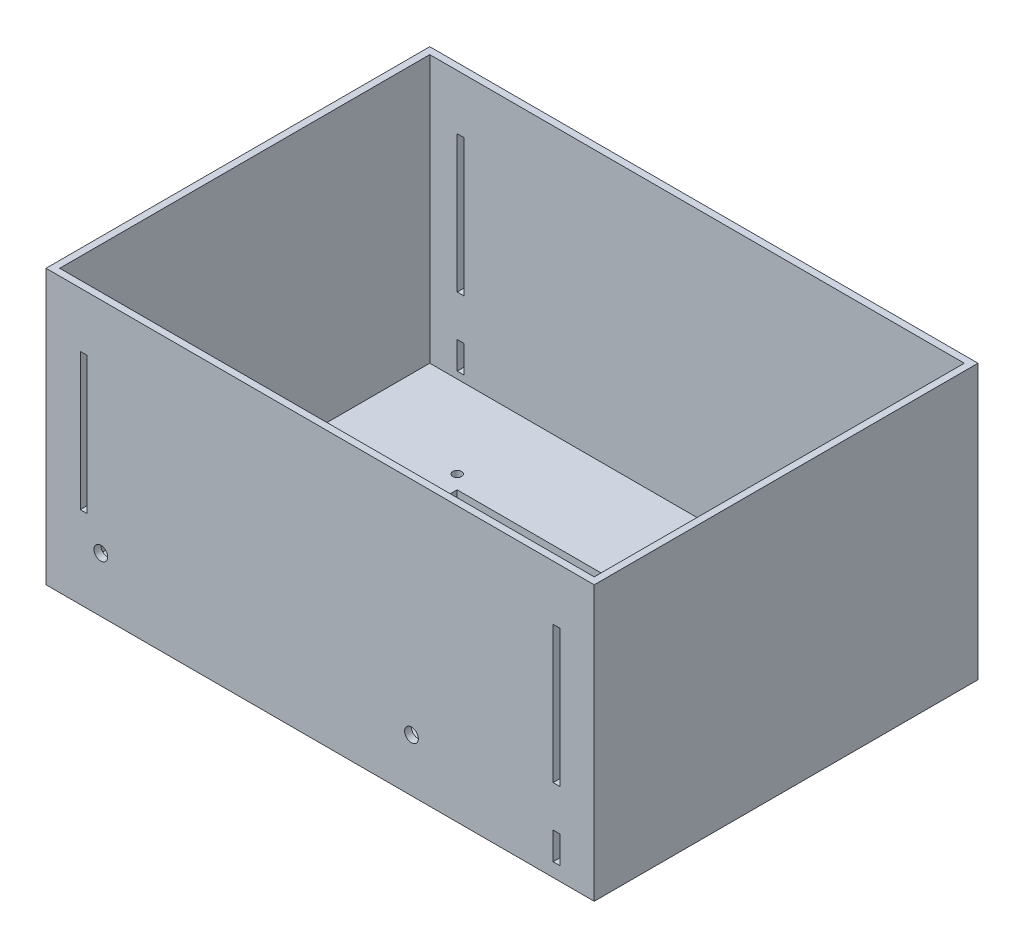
ISO-10303-21;
HEADER;
FILE_DESCRIPTION(('STEP AP214'),'2;1');
FILE_NAME('part.step','',(''),(''),'','','');
FILE_SCHEMA(('AUTOMOTIVE_DESIGN { 1 0 10303 214 1 1 1 1 }'));
ENDSEC;
DATA;
#1=APPLICATION_CONTEXT('core data for automotive mechanical design processes');
#2=APPLICATION_PROTOCOL_DEFINITION('international standard','automotive_design',2000,#1);
#3=PRODUCT_CONTEXT('',#1,'mechanical');
#4=PRODUCT('Part','Part','',(#3));
#5=PRODUCT_RELATED_PRODUCT_CATEGORY('part','',(#4));
#6=PRODUCT_DEFINITION_FORMATION('','',#4);
#7=PRODUCT_DEFINITION_CONTEXT('part definition',#1,'design');
#8=PRODUCT_DEFINITION('design','',#6,#7);
#9=PRODUCT_DEFINITION_SHAPE('','',#8);
#10=(LENGTH_UNIT() NAMED_UNIT(*) SI_UNIT(.MILLI.,.METRE.));
#11=(NAMED_UNIT(*) PLANE_ANGLE_UNIT() SI_UNIT($,.RADIAN.));
#12=(NAMED_UNIT(*) SI_UNIT($,.STERADIAN.) SOLID_ANGLE_UNIT());
#13=UNCERTAINTY_MEASURE_WITH_UNIT(LENGTH_MEASURE(1.E-05),#10,'distance_accuracy_value','');
#14=(GEOMETRIC_REPRESENTATION_CONTEXT(3) GLOBAL_UNCERTAINTY_ASSIGNED_CONTEXT((#13)) GLOBAL_UNIT_ASSIGNED_CONTEXT((#10,
#11,#12)) REPRESENTATION_CONTEXT('',''));
#15=CARTESIAN_POINT('',(0.,0.,0.));
#16=DIRECTION('',(0.,0.,1.));
#17=DIRECTION('',(1.,0.,0.));
#18=AXIS2_PLACEMENT_3D('',#15,#16,#17);
#19=CARTESIAN_POINT('',(127.,3.175,-88.9));
#20=DIRECTION('',(0.,-1.,0.));
#21=DIRECTION('',(0.,0.,-1.));
#22=AXIS2_PLACEMENT_3D('',#19,#20,#21);
#23=PLANE('',#22);
#24=DIRECTION('',(-1.,0.,0.));
#25=VECTOR('',#24,1.);
#26=CARTESIAN_POINT('',(-123.825,3.175,-85.725));
#27=LINE('',#26,#25);
#28=CARTESIAN_POINT('',(123.825,3.175,-85.725));
#29=VERTEX_POINT('',#28);
#30=CARTESIAN_POINT('',(-123.825,3.175,-85.725));
#31=VERTEX_POINT('',#30);
#32=EDGE_CURVE('E459',#29,#31,#27,.T.);
#33=ORIENTED_EDGE('',*,*,#32,.T.);
#34=DIRECTION('',(0.,0.,1.));
#35=VECTOR('',#34,1.);
#36=CARTESIAN_POINT('',(-123.825,3.175,85.725));
#37=LINE('',#36,#35);
#38=CARTESIAN_POINT('',(-123.825,3.175,85.725));
#39=VERTEX_POINT('',#38);
#40=EDGE_CURVE('E467',#31,#39,#37,.T.);
#41=ORIENTED_EDGE('',*,*,#40,.T.);
#42=DIRECTION('',(1.,0.,0.));
#43=VECTOR('',#42,1.);
#44=CARTESIAN_POINT('',(-123.825,3.175,85.725));
#45=LINE('',#44,#43);
#46=CARTESIAN_POINT('',(123.825,3.175,85.725));
#47=VERTEX_POINT('',#46);
#48=EDGE_CURVE('E470',#39,#47,#45,.T.);
#49=ORIENTED_EDGE('',*,*,#48,.T.);
#50=DIRECTION('',(0.,0.,-1.));
#51=VECTOR('',#50,1.);
#52=CARTESIAN_POINT('',(123.825,3.175,85.725));
#53=LINE('',#52,#51);
#54=EDGE_CURVE('E473',#47,#29,#53,.T.);
#55=ORIENTED_EDGE('',*,*,#54,.T.);
#56=EDGE_LOOP('',(#33,#41,#49,#55));
#57=FACE_BOUND('',#56,.T.);
#58=CARTESIAN_POINT('',(-73.025,3.175,47.625));
#59=DIRECTION('',(0.,1.,0.));
#60=DIRECTION('',(0.,0.,-1.));
#61=AXIS2_PLACEMENT_3D('',#58,#59,#60);
#62=CIRCLE('',#61,2.04469999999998);
#63=CARTESIAN_POINT('',(-73.025,3.175,45.5803));
#64=VERTEX_POINT('',#63);
#65=EDGE_CURVE('E505',#64,#64,#62,.T.);
#66=ORIENTED_EDGE('',*,*,#65,.F.);
#67=EDGE_LOOP('',(#66));
#68=FACE_BOUND('',#67,.T.);
#69=CARTESIAN_POINT('',(-73.025,3.175,-47.625));
#70=DIRECTION('',(0.,1.,0.));
#71=DIRECTION('',(0.,0.,1.));
#72=AXIS2_PLACEMENT_3D('',#69,#70,#71);
#73=CIRCLE('',#72,2.04469999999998);
#74=CARTESIAN_POINT('',(-73.025,3.175,-45.5803));
#75=VERTEX_POINT('',#74);
#76=EDGE_CURVE('E517',#75,#75,#73,.T.);
#77=ORIENTED_EDGE('',*,*,#76,.F.);
#78=EDGE_LOOP('',(#77));
#79=FACE_BOUND('',#78,.T.);
#80=DIRECTION('',(0.,0.,1.));
#81=VECTOR('',#80,1.);
#82=CARTESIAN_POINT('',(-66.675,3.175,-41.275));
#83=LINE('',#82,#81);
#84=CARTESIAN_POINT('',(-66.675,3.175,-41.275));
#85=VERTEX_POINT('',#84);
#86=CARTESIAN_POINT('',(-66.675,3.175,41.275));
#87=VERTEX_POINT('',#86);
#88=EDGE_CURVE('E523',#85,#87,#83,.T.);
#89=ORIENTED_EDGE('',*,*,#88,.F.);
#90=DIRECTION('',(-1.,0.,0.));
#91=VECTOR('',#90,1.);
#92=CARTESIAN_POINT('',(-66.675,3.175,-41.275));
#93=LINE('',#92,#91);
#94=CARTESIAN_POINT('',(66.675,3.175,-41.275));
#95=VERTEX_POINT('',#94);
#96=EDGE_CURVE('E531',#95,#85,#93,.T.);
#97=ORIENTED_EDGE('',*,*,#96,.F.);
#98=DIRECTION('',(0.,0.,-1.));
#99=VECTOR('',#98,1.);
#100=CARTESIAN_POINT('',(66.675,3.175,-41.275));
#101=LINE('',#100,#99);
#102=CARTESIAN_POINT('',(66.675,3.175,41.275));
#103=VERTEX_POINT('',#102);
#104=EDGE_CURVE('E528',#103,#95,#101,.T.);
#105=ORIENTED_EDGE('',*,*,#104,.F.);
#106=DIRECTION('',(1.,0.,0.));
#107=VECTOR('',#106,1.);
#108=CARTESIAN_POINT('',(-66.675,3.175,41.275));
#109=LINE('',#108,#107);
#110=EDGE_CURVE('E525',#87,#103,#109,.T.);
#111=ORIENTED_EDGE('',*,*,#110,.F.);
#112=EDGE_LOOP('',(#89,#97,#105,#111));
#113=FACE_BOUND('',#112,.T.);
#114=CARTESIAN_POINT('',(73.025,3.175,-47.625));
#115=DIRECTION('',(0.,1.,0.));
#116=DIRECTION('',(0.,0.,-1.));
#117=AXIS2_PLACEMENT_3D('',#114,#115,#116);
#118=CIRCLE('',#117,2.04469999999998);
#119=CARTESIAN_POINT('',(73.025,3.175,-49.6697));
#120=VERTEX_POINT('',#119);
#121=EDGE_CURVE('E511',#120,#120,#118,.T.);
#122=ORIENTED_EDGE('',*,*,#121,.F.);
#123=EDGE_LOOP('',(#122));
#124=FACE_BOUND('',#123,.T.);
#125=CARTESIAN_POINT('',(73.025,3.175,47.625));
#126=DIRECTION('',(0.,1.,0.));
#127=DIRECTION('',(0.,0.,1.));
#128=AXIS2_PLACEMENT_3D('',#125,#126,#127);
#129=CIRCLE('',#128,2.04469999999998);
#130=CARTESIAN_POINT('',(73.025,3.175,49.6697));
#131=VERTEX_POINT('',#130);
#132=EDGE_CURVE('E499',#131,#131,#129,.T.);
#133=ORIENTED_EDGE('',*,*,#132,.F.);
#134=EDGE_LOOP('',(#133));
#135=FACE_BOUND('',#134,.T.);
#136=ADVANCED_FACE('F43',(#57,#68,#79,#113,#124,#135),#23,.F.);
#137=CARTESIAN_POINT('',(127.,0.,-88.9));
#138=DIRECTION('',(0.,-1.,0.));
#139=DIRECTION('',(0.,0.,-1.));
#140=AXIS2_PLACEMENT_3D('',#137,#138,#139);
#141=PLANE('',#140);
#142=CARTESIAN_POINT('',(-73.025,0.,47.625));
#143=DIRECTION('',(0.,1.,0.));
#144=DIRECTION('',(0.,0.,-1.));
#145=AXIS2_PLACEMENT_3D('',#142,#143,#144);
#146=CIRCLE('',#145,2.04469999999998);
#147=CARTESIAN_POINT('',(-73.025,0.,45.5803));
#148=VERTEX_POINT('',#147);
#149=EDGE_CURVE('E502',#148,#148,#146,.T.);
#150=ORIENTED_EDGE('',*,*,#149,.T.);
#151=EDGE_LOOP('',(#150));
#152=FACE_BOUND('',#151,.T.);
#153=CARTESIAN_POINT('',(-73.025,0.,-47.625));
#154=DIRECTION('',(0.,1.,0.));
#155=DIRECTION('',(0.,0.,1.));
#156=AXIS2_PLACEMENT_3D('',#153,#154,#155);
#157=CIRCLE('',#156,2.04469999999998);
#158=CARTESIAN_POINT('',(-73.025,0.,-45.5803));
#159=VERTEX_POINT('',#158);
#160=EDGE_CURVE('E514',#159,#159,#157,.T.);
#161=ORIENTED_EDGE('',*,*,#160,.T.);
#162=EDGE_LOOP('',(#161));
#163=FACE_BOUND('',#162,.T.);
#164=DIRECTION('',(0.,0.,-1.));
#165=VECTOR('',#164,1.);
#166=CARTESIAN_POINT('',(127.,0.,88.9));
#167=LINE('',#166,#165);
#168=CARTESIAN_POINT('',(127.,0.,88.9));
#169=VERTEX_POINT('',#168);
#170=CARTESIAN_POINT('',(127.,0.,-88.9));
#171=VERTEX_POINT('',#170);
#172=EDGE_CURVE('E553',#169,#171,#167,.T.);
#173=ORIENTED_EDGE('',*,*,#172,.F.);
#174=DIRECTION('',(1.,0.,0.));
#175=VECTOR('',#174,1.);
#176=CARTESIAN_POINT('',(-127.,0.,88.9));
#177=LINE('',#176,#175);
#178=CARTESIAN_POINT('',(-127.,0.,88.9));
#179=VERTEX_POINT('',#178);
#180=EDGE_CURVE('E560',#179,#169,#177,.T.);
#181=ORIENTED_EDGE('',*,*,#180,.F.);
#182=DIRECTION('',(0.,0.,1.));
#183=VECTOR('',#182,1.);
#184=CARTESIAN_POINT('',(-127.,0.,88.9));
#185=LINE('',#184,#183);
#186=CARTESIAN_POINT('',(-127.,0.,-88.9));
#187=VERTEX_POINT('',#186);
#188=EDGE_CURVE('E558',#187,#179,#185,.T.);
#189=ORIENTED_EDGE('',*,*,#188,.F.);
#190=DIRECTION('',(-1.,0.,0.));
#191=VECTOR('',#190,1.);
#192=CARTESIAN_POINT('',(-127.,0.,-88.9));
#193=LINE('',#192,#191);
#194=EDGE_CURVE('E556',#171,#187,#193,.T.);
#195=ORIENTED_EDGE('',*,*,#194,.F.);
#196=EDGE_LOOP('',(#173,#181,#189,#195));
#197=FACE_BOUND('',#196,.T.);
#198=DIRECTION('',(-1.,0.,0.));
#199=VECTOR('',#198,1.);
#200=CARTESIAN_POINT('',(-66.675,0.,-41.275));
#201=LINE('',#200,#199);
#202=CARTESIAN_POINT('',(66.675,0.,-41.275));
#203=VERTEX_POINT('',#202);
#204=CARTESIAN_POINT('',(-66.675,0.,-41.275));
#205=VERTEX_POINT('',#204);
#206=EDGE_CURVE('E526',#203,#205,#201,.T.);
#207=ORIENTED_EDGE('',*,*,#206,.T.);
#208=DIRECTION('',(0.,0.,1.));
#209=VECTOR('',#208,1.);
#210=CARTESIAN_POINT('',(-66.675,0.,-41.275));
#211=LINE('',#210,#209);
#212=CARTESIAN_POINT('',(-66.675,0.,41.275));
#213=VERTEX_POINT('',#212);
#214=EDGE_CURVE('E520',#205,#213,#211,.T.);
#215=ORIENTED_EDGE('',*,*,#214,.T.);
#216=DIRECTION('',(1.,0.,0.));
#217=VECTOR('',#216,1.);
#218=CARTESIAN_POINT('',(-66.675,0.,41.275));
#219=LINE('',#218,#217);
#220=CARTESIAN_POINT('',(66.675,0.,41.275));
#221=VERTEX_POINT('',#220);
#222=EDGE_CURVE('E536',#213,#221,#219,.T.);
#223=ORIENTED_EDGE('',*,*,#222,.T.);
#224=DIRECTION('',(0.,0.,-1.));
#225=VECTOR('',#224,1.);
#226=CARTESIAN_POINT('',(66.675,0.,-41.275));
#227=LINE('',#226,#225);
#228=EDGE_CURVE('E539',#221,#203,#227,.T.);
#229=ORIENTED_EDGE('',*,*,#228,.T.);
#230=EDGE_LOOP('',(#207,#215,#223,#229));
#231=FACE_BOUND('',#230,.T.);
#232=CARTESIAN_POINT('',(73.025,0.,-47.625));
#233=DIRECTION('',(0.,1.,0.));
#234=DIRECTION('',(0.,0.,-1.));
#235=AXIS2_PLACEMENT_3D('',#232,#233,#234);
#236=CIRCLE('',#235,2.04469999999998);
#237=CARTESIAN_POINT('',(73.025,0.,-49.6697));
#238=VERTEX_POINT('',#237);
#239=EDGE_CURVE('E508',#238,#238,#236,.T.);
#240=ORIENTED_EDGE('',*,*,#239,.T.);
#241=EDGE_LOOP('',(#240));
#242=FACE_BOUND('',#241,.T.);
#243=CARTESIAN_POINT('',(73.025,0.,47.625));
#244=DIRECTION('',(0.,1.,0.));
#245=DIRECTION('',(0.,0.,1.));
#246=AXIS2_PLACEMENT_3D('',#243,#244,#245);
#247=CIRCLE('',#246,2.04469999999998);
#248=CARTESIAN_POINT('',(73.025,0.,49.6697));
#249=VERTEX_POINT('',#248);
#250=EDGE_CURVE('E498',#249,#249,#247,.T.);
#251=ORIENTED_EDGE('',*,*,#250,.T.);
#252=EDGE_LOOP('',(#251));
#253=FACE_BOUND('',#252,.T.);
#254=ADVANCED_FACE('F626',(#152,#163,#197,#231,#242,#253),#141,.T.);
#255=CARTESIAN_POINT('',(127.,3.175,88.9));
#256=DIRECTION('',(-1.,0.,0.));
#257=DIRECTION('',(0.,0.,1.));
#258=AXIS2_PLACEMENT_3D('',#255,#256,#257);
#259=PLANE('',#258);
#260=ORIENTED_EDGE('',*,*,#172,.T.);
#261=DIRECTION('',(0.,-1.,0.));
#262=VECTOR('',#261,1.);
#263=CARTESIAN_POINT('',(127.,3.175,-88.9));
#264=LINE('',#263,#262);
#265=CARTESIAN_POINT('',(127.,127.,-88.9));
#266=VERTEX_POINT('',#265);
#267=EDGE_CURVE('E571',#266,#171,#264,.T.);
#268=ORIENTED_EDGE('',*,*,#267,.F.);
#269=DIRECTION('',(0.,0.,-1.));
#270=VECTOR('',#269,1.);
#271=CARTESIAN_POINT('',(127.,127.,88.9));
#272=LINE('',#271,#270);
#273=CARTESIAN_POINT('',(127.,127.,88.9));
#274=VERTEX_POINT('',#273);
#275=EDGE_CURVE('E492',#274,#266,#272,.T.);
#276=ORIENTED_EDGE('',*,*,#275,.F.);
#277=DIRECTION('',(0.,-1.,0.));
#278=VECTOR('',#277,1.);
#279=CARTESIAN_POINT('',(127.,3.175,88.9));
#280=LINE('',#279,#278);
#281=EDGE_CURVE('E562',#274,#169,#280,.T.);
#282=ORIENTED_EDGE('',*,*,#281,.T.);
#283=EDGE_LOOP('',(#260,#268,#276,#282));
#284=FACE_BOUND('',#283,.T.);
#285=ADVANCED_FACE('F45',(#284),#259,.F.);
#286=CARTESIAN_POINT('',(-127.,3.175,-88.9));
#287=DIRECTION('',(0.,0.,1.));
#288=DIRECTION('',(1.,0.,0.));
#289=AXIS2_PLACEMENT_3D('',#286,#287,#288);
#290=PLANE('',#289);
#291=DIRECTION('',(-1.,0.,0.));
#292=VECTOR('',#291,1.);
#293=CARTESIAN_POINT('',(-107.949999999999,6.35,-88.9));
#294=LINE('',#293,#292);
#295=CARTESIAN_POINT('',(-107.949999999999,6.35,-88.9));
#296=VERTEX_POINT('',#295);
#297=CARTESIAN_POINT('',(-111.124999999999,6.35,-88.9));
#298=VERTEX_POINT('',#297);
#299=EDGE_CURVE('E304',#296,#298,#294,.T.);
#300=ORIENTED_EDGE('',*,*,#299,.F.);
#301=DIRECTION('',(0.,-1.,0.));
#302=VECTOR('',#301,1.);
#303=CARTESIAN_POINT('',(-107.949999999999,6.35,-88.9));
#304=LINE('',#303,#302);
#305=CARTESIAN_POINT('',(-107.949999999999,19.05,-88.9));
#306=VERTEX_POINT('',#305);
#307=EDGE_CURVE('E59',#306,#296,#304,.T.);
#308=ORIENTED_EDGE('',*,*,#307,.F.);
#309=DIRECTION('',(1.,0.,0.));
#310=VECTOR('',#309,1.);
#311=CARTESIAN_POINT('',(-107.949999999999,19.05,-88.9));
#312=LINE('',#311,#310);
#313=CARTESIAN_POINT('',(-111.124999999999,19.05,-88.9));
#314=VERTEX_POINT('',#313);
#315=EDGE_CURVE('E295',#314,#306,#312,.T.);
#316=ORIENTED_EDGE('',*,*,#315,.F.);
#317=DIRECTION('',(0.,1.,0.));
#318=VECTOR('',#317,1.);
#319=CARTESIAN_POINT('',(-111.124999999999,6.35,-88.9));
#320=LINE('',#319,#318);
#321=EDGE_CURVE('E298',#298,#314,#320,.T.);
#322=ORIENTED_EDGE('',*,*,#321,.F.);
#323=EDGE_LOOP('',(#300,#308,#316,#322));
#324=FACE_BOUND('',#323,.T.);
#325=CARTESIAN_POINT('',(42.3291,24.4263333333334,-88.9));
#326=DIRECTION('',(0.,0.,1.));
#327=DIRECTION('',(1.,0.,0.));
#328=AXIS2_PLACEMENT_3D('',#325,#326,#327);
#329=CIRCLE('',#328,3.175);
#330=CARTESIAN_POINT('',(45.5041,24.4263333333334,-88.9));
#331=VERTEX_POINT('',#330);
#332=EDGE_CURVE('E346',#331,#331,#329,.T.);
#333=ORIENTED_EDGE('',*,*,#332,.T.);
#334=EDGE_LOOP('',(#333));
#335=FACE_BOUND('',#334,.T.);
#336=DIRECTION('',(-1.,0.,0.));
#337=VECTOR('',#336,1.);
#338=CARTESIAN_POINT('',(107.950000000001,101.6,-88.9));
#339=LINE('',#338,#337);
#340=CARTESIAN_POINT('',(111.125000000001,101.6,-88.9));
#341=VERTEX_POINT('',#340);
#342=CARTESIAN_POINT('',(107.950000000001,101.6,-88.9));
#343=VERTEX_POINT('',#342);
#344=EDGE_CURVE('E374',#341,#343,#339,.T.);
#345=ORIENTED_EDGE('',*,*,#344,.T.);
#346=DIRECTION('',(0.,-1.,0.));
#347=VECTOR('',#346,1.);
#348=CARTESIAN_POINT('',(107.950000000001,38.1000000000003,-88.9));
#349=LINE('',#348,#347);
#350=CARTESIAN_POINT('',(107.950000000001,38.1000000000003,-88.9));
#351=VERTEX_POINT('',#350);
#352=EDGE_CURVE('E365',#343,#351,#349,.T.);
#353=ORIENTED_EDGE('',*,*,#352,.T.);
#354=DIRECTION('',(1.,0.,0.));
#355=VECTOR('',#354,1.);
#356=CARTESIAN_POINT('',(107.950000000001,38.1000000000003,-88.9));
#357=LINE('',#356,#355);
#358=CARTESIAN_POINT('',(111.125000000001,38.1000000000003,-88.9));
#359=VERTEX_POINT('',#358);
#360=EDGE_CURVE('E368',#351,#359,#357,.T.);
#361=ORIENTED_EDGE('',*,*,#360,.T.);
#362=DIRECTION('',(0.,1.,0.));
#363=VECTOR('',#362,1.);
#364=CARTESIAN_POINT('',(111.125000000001,38.1000000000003,-88.9));
#365=LINE('',#364,#363);
#366=EDGE_CURVE('E371',#359,#341,#365,.T.);
#367=ORIENTED_EDGE('',*,*,#366,.T.);
#368=EDGE_LOOP('',(#345,#353,#361,#367));
#369=FACE_BOUND('',#368,.T.);
#370=DIRECTION('',(1.,0.,0.));
#371=VECTOR('',#370,1.);
#372=CARTESIAN_POINT('',(-111.124999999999,38.1000000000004,-88.9));
#373=LINE('',#372,#371);
#374=CARTESIAN_POINT('',(-111.124999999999,38.1000000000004,-88.9));
#375=VERTEX_POINT('',#374);
#376=CARTESIAN_POINT('',(-107.949999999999,38.1000000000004,-88.9));
#377=VERTEX_POINT('',#376);
#378=EDGE_CURVE('E421',#375,#377,#373,.T.);
#379=ORIENTED_EDGE('',*,*,#378,.T.);
#380=DIRECTION('',(0.,1.,0.));
#381=VECTOR('',#380,1.);
#382=CARTESIAN_POINT('',(-107.949999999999,88.9,-88.9));
#383=LINE('',#382,#381);
#384=CARTESIAN_POINT('',(-107.949999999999,101.6,-88.9));
#385=VERTEX_POINT('',#384);
#386=EDGE_CURVE('E412',#377,#385,#383,.T.);
#387=ORIENTED_EDGE('',*,*,#386,.T.);
#388=DIRECTION('',(-1.,0.,0.));
#389=VECTOR('',#388,1.);
#390=CARTESIAN_POINT('',(-111.124999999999,101.6,-88.9));
#391=LINE('',#390,#389);
#392=CARTESIAN_POINT('',(-111.124999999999,101.6,-88.9));
#393=VERTEX_POINT('',#392);
#394=EDGE_CURVE('E415',#385,#393,#391,.T.);
#395=ORIENTED_EDGE('',*,*,#394,.T.);
#396=DIRECTION('',(0.,-1.,0.));
#397=VECTOR('',#396,1.);
#398=CARTESIAN_POINT('',(-111.124999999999,88.9,-88.9));
#399=LINE('',#398,#397);
#400=EDGE_CURVE('E418',#393,#375,#399,.T.);
#401=ORIENTED_EDGE('',*,*,#400,.T.);
#402=EDGE_LOOP('',(#379,#387,#395,#401));
#403=FACE_BOUND('',#402,.T.);
#404=CARTESIAN_POINT('',(85.00618,25.4,-88.9));
#405=DIRECTION('',(0.,0.,-1.));
#406=DIRECTION('',(-1.,0.,0.));
#407=AXIS2_PLACEMENT_3D('',#404,#405,#406);
#408=CIRCLE('',#407,3.175);
#409=CARTESIAN_POINT('',(81.83118,25.4,-88.9));
#410=VERTEX_POINT('',#409);
#411=EDGE_CURVE('E448',#410,#410,#408,.T.);
#412=ORIENTED_EDGE('',*,*,#411,.F.);
#413=EDGE_LOOP('',(#412));
#414=FACE_BOUND('',#413,.T.);
#415=ORIENTED_EDGE('',*,*,#194,.T.);
#416=DIRECTION('',(0.,-1.,0.));
#417=VECTOR('',#416,1.);
#418=CARTESIAN_POINT('',(-127.,3.175,-88.9));
#419=LINE('',#418,#417);
#420=CARTESIAN_POINT('',(-127.,127.,-88.9));
#421=VERTEX_POINT('',#420);
#422=EDGE_CURVE('E568',#421,#187,#419,.T.);
#423=ORIENTED_EDGE('',*,*,#422,.F.);
#424=DIRECTION('',(-1.,0.,0.));
#425=VECTOR('',#424,1.);
#426=CARTESIAN_POINT('',(-127.,127.,-88.9));
#427=LINE('',#426,#425);
#428=EDGE_CURVE('E495',#266,#421,#427,.T.);
#429=ORIENTED_EDGE('',*,*,#428,.F.);
#430=ORIENTED_EDGE('',*,*,#267,.T.);
#431=EDGE_LOOP('',(#415,#423,#429,#430));
#432=FACE_BOUND('',#431,.T.);
#433=ADVANCED_FACE('F610',(#324,#335,#369,#403,#414,#432),#290,.F.);
#434=CARTESIAN_POINT('',(-127.,3.175,88.9));
#435=DIRECTION('',(1.,0.,0.));
#436=DIRECTION('',(0.,0.,-1.));
#437=AXIS2_PLACEMENT_3D('',#434,#435,#436);
#438=PLANE('',#437);
#439=ORIENTED_EDGE('',*,*,#188,.T.);
#440=DIRECTION('',(0.,-1.,0.));
#441=VECTOR('',#440,1.);
#442=CARTESIAN_POINT('',(-127.,3.175,88.9));
#443=LINE('',#442,#441);
#444=CARTESIAN_POINT('',(-127.,127.,88.9));
#445=VERTEX_POINT('',#444);
#446=EDGE_CURVE('E565',#445,#179,#443,.T.);
#447=ORIENTED_EDGE('',*,*,#446,.F.);
#448=DIRECTION('',(0.,0.,1.));
#449=VECTOR('',#448,1.);
#450=CARTESIAN_POINT('',(-127.,127.,88.9));
#451=LINE('',#450,#449);
#452=EDGE_CURVE('E486',#421,#445,#451,.T.);
#453=ORIENTED_EDGE('',*,*,#452,.F.);
#454=ORIENTED_EDGE('',*,*,#422,.T.);
#455=EDGE_LOOP('',(#439,#447,#453,#454));
#456=FACE_BOUND('',#455,.T.);
#457=ADVANCED_FACE('F613',(#456),#438,.F.);
#458=CARTESIAN_POINT('',(-127.,3.175,88.9));
#459=DIRECTION('',(0.,0.,-1.));
#460=DIRECTION('',(-1.,0.,0.));
#461=AXIS2_PLACEMENT_3D('',#458,#459,#460);
#462=PLANE('',#461);
#463=DIRECTION('',(1.,0.,0.));
#464=VECTOR('',#463,1.);
#465=CARTESIAN_POINT('',(107.950000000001,6.35,88.9));
#466=LINE('',#465,#464);
#467=CARTESIAN_POINT('',(107.950000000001,6.35,88.9));
#468=VERTEX_POINT('',#467);
#469=CARTESIAN_POINT('',(111.125000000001,6.35,88.9));
#470=VERTEX_POINT('',#469);
#471=EDGE_CURVE('E329',#468,#470,#466,.T.);
#472=ORIENTED_EDGE('',*,*,#471,.F.);
#473=DIRECTION('',(0.,-1.,0.));
#474=VECTOR('',#473,1.);
#475=CARTESIAN_POINT('',(107.950000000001,6.35,88.9));
#476=LINE('',#475,#474);
#477=CARTESIAN_POINT('',(107.950000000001,19.05,88.9));
#478=VERTEX_POINT('',#477);
#479=EDGE_CURVE('E310',#478,#468,#476,.T.);
#480=ORIENTED_EDGE('',*,*,#479,.F.);
#481=DIRECTION('',(-1.,0.,0.));
#482=VECTOR('',#481,1.);
#483=CARTESIAN_POINT('',(107.950000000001,19.05,88.9));
#484=LINE('',#483,#482);
#485=CARTESIAN_POINT('',(111.125000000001,19.05,88.9));
#486=VERTEX_POINT('',#485);
#487=EDGE_CURVE('E318',#486,#478,#484,.T.);
#488=ORIENTED_EDGE('',*,*,#487,.F.);
#489=DIRECTION('',(0.,1.,0.));
#490=VECTOR('',#489,1.);
#491=CARTESIAN_POINT('',(111.125000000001,6.35,88.9));
#492=LINE('',#491,#490);
#493=EDGE_CURVE('E332',#470,#486,#492,.T.);
#494=ORIENTED_EDGE('',*,*,#493,.F.);
#495=EDGE_LOOP('',(#472,#480,#488,#494));
#496=FACE_BOUND('',#495,.T.);
#497=CARTESIAN_POINT('',(42.3291,24.4263333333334,88.9));
#498=DIRECTION('',(0.,0.,1.));
#499=DIRECTION('',(1.,0.,0.));
#500=AXIS2_PLACEMENT_3D('',#497,#498,#499);
#501=CIRCLE('',#500,3.175);
#502=CARTESIAN_POINT('',(45.5041,24.4263333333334,88.9));
#503=VERTEX_POINT('',#502);
#504=EDGE_CURVE('E339',#503,#503,#501,.T.);
#505=ORIENTED_EDGE('',*,*,#504,.F.);
#506=EDGE_LOOP('',(#505));
#507=FACE_BOUND('',#506,.T.);
#508=DIRECTION('',(1.,0.,0.));
#509=VECTOR('',#508,1.);
#510=CARTESIAN_POINT('',(107.950000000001,38.1000000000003,88.9));
#511=LINE('',#510,#509);
#512=CARTESIAN_POINT('',(107.950000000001,38.1000000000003,88.9));
#513=VERTEX_POINT('',#512);
#514=CARTESIAN_POINT('',(111.125000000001,38.1000000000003,88.9));
#515=VERTEX_POINT('',#514);
#516=EDGE_CURVE('E356',#513,#515,#511,.T.);
#517=ORIENTED_EDGE('',*,*,#516,.F.);
#518=DIRECTION('',(0.,-1.,0.));
#519=VECTOR('',#518,1.);
#520=CARTESIAN_POINT('',(107.950000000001,38.1000000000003,88.9));
#521=LINE('',#520,#519);
#522=CARTESIAN_POINT('',(107.950000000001,101.6,88.9));
#523=VERTEX_POINT('',#522);
#524=EDGE_CURVE('E354',#523,#513,#521,.T.);
#525=ORIENTED_EDGE('',*,*,#524,.F.);
#526=DIRECTION('',(-1.,0.,0.));
#527=VECTOR('',#526,1.);
#528=CARTESIAN_POINT('',(107.950000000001,101.6,88.9));
#529=LINE('',#528,#527);
#530=CARTESIAN_POINT('',(111.125000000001,101.6,88.9));
#531=VERTEX_POINT('',#530);
#532=EDGE_CURVE('E362',#531,#523,#529,.T.);
#533=ORIENTED_EDGE('',*,*,#532,.F.);
#534=DIRECTION('',(0.,1.,0.));
#535=VECTOR('',#534,1.);
#536=CARTESIAN_POINT('',(111.125000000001,38.1000000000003,88.9));
#537=LINE('',#536,#535);
#538=EDGE_CURVE('E359',#515,#531,#537,.T.);
#539=ORIENTED_EDGE('',*,*,#538,.F.);
#540=EDGE_LOOP('',(#517,#525,#533,#539));
#541=FACE_BOUND('',#540,.T.);
#542=DIRECTION('',(-1.,0.,0.));
#543=VECTOR('',#542,1.);
#544=CARTESIAN_POINT('',(-111.124999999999,101.6,88.9));
#545=LINE('',#544,#543);
#546=CARTESIAN_POINT('',(-107.949999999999,101.6,88.9));
#547=VERTEX_POINT('',#546);
#548=CARTESIAN_POINT('',(-111.124999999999,101.6,88.9));
#549=VERTEX_POINT('',#548);
#550=EDGE_CURVE('E403',#547,#549,#545,.T.);
#551=ORIENTED_EDGE('',*,*,#550,.F.);
#552=DIRECTION('',(0.,1.,0.));
#553=VECTOR('',#552,1.);
#554=CARTESIAN_POINT('',(-107.949999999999,88.9,88.9));
#555=LINE('',#554,#553);
#556=CARTESIAN_POINT('',(-107.949999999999,38.1000000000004,88.9));
#557=VERTEX_POINT('',#556);
#558=EDGE_CURVE('E401',#557,#547,#555,.T.);
#559=ORIENTED_EDGE('',*,*,#558,.F.);
#560=DIRECTION('',(1.,0.,0.));
#561=VECTOR('',#560,1.);
#562=CARTESIAN_POINT('',(-111.124999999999,38.1000000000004,88.9));
#563=LINE('',#562,#561);
#564=CARTESIAN_POINT('',(-111.124999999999,38.1000000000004,88.9));
#565=VERTEX_POINT('',#564);
#566=EDGE_CURVE('E409',#565,#557,#563,.T.);
#567=ORIENTED_EDGE('',*,*,#566,.F.);
#568=DIRECTION('',(0.,-1.,0.));
#569=VECTOR('',#568,1.);
#570=CARTESIAN_POINT('',(-111.124999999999,88.9,88.9));
#571=LINE('',#570,#569);
#572=EDGE_CURVE('E406',#549,#565,#571,.T.);
#573=ORIENTED_EDGE('',*,*,#572,.F.);
#574=EDGE_LOOP('',(#551,#559,#567,#573));
#575=FACE_BOUND('',#574,.T.);
#576=CARTESIAN_POINT('',(-101.6,25.4,88.9));
#577=DIRECTION('',(0.,0.,1.));
#578=DIRECTION('',(1.,0.,0.));
#579=AXIS2_PLACEMENT_3D('',#576,#577,#578);
#580=CIRCLE('',#579,3.175);
#581=CARTESIAN_POINT('',(-98.425,25.4,88.9));
#582=VERTEX_POINT('',#581);
#583=EDGE_CURVE('E452',#582,#582,#580,.T.);
#584=ORIENTED_EDGE('',*,*,#583,.F.);
#585=EDGE_LOOP('',(#584));
#586=FACE_BOUND('',#585,.T.);
#587=ORIENTED_EDGE('',*,*,#180,.T.);
#588=ORIENTED_EDGE('',*,*,#281,.F.);
#589=DIRECTION('',(1.,0.,0.));
#590=VECTOR('',#589,1.);
#591=CARTESIAN_POINT('',(-127.,127.,88.9));
#592=LINE('',#591,#590);
#593=EDGE_CURVE('E489',#445,#274,#592,.T.);
#594=ORIENTED_EDGE('',*,*,#593,.F.);
#595=ORIENTED_EDGE('',*,*,#446,.T.);
#596=EDGE_LOOP('',(#587,#588,#594,#595));
#597=FACE_BOUND('',#596,.T.);
#598=ADVANCED_FACE('F629',(#496,#507,#541,#575,#586,#597),#462,.F.);
#599=CARTESIAN_POINT('',(-66.675,3.175,-41.275));
#600=DIRECTION('',(1.,0.,0.));
#601=DIRECTION('',(0.,0.,-1.));
#602=AXIS2_PLACEMENT_3D('',#599,#600,#601);
#603=PLANE('',#602);
#604=ORIENTED_EDGE('',*,*,#214,.F.);
#605=DIRECTION('',(0.,-1.,0.));
#606=VECTOR('',#605,1.);
#607=CARTESIAN_POINT('',(-66.675,3.175,-41.275));
#608=LINE('',#607,#606);
#609=EDGE_CURVE('E533',#85,#205,#608,.T.);
#610=ORIENTED_EDGE('',*,*,#609,.F.);
#611=ORIENTED_EDGE('',*,*,#88,.T.);
#612=DIRECTION('',(0.,-1.,0.));
#613=VECTOR('',#612,1.);
#614=CARTESIAN_POINT('',(-66.675,3.175,41.275));
#615=LINE('',#614,#613);
#616=EDGE_CURVE('E550',#87,#213,#615,.T.);
#617=ORIENTED_EDGE('',*,*,#616,.T.);
#618=EDGE_LOOP('',(#604,#610,#611,#617));
#619=FACE_BOUND('',#618,.T.);
#620=ADVANCED_FACE('F676',(#619),#603,.T.);
#621=CARTESIAN_POINT('',(-66.675,3.175,41.275));
#622=DIRECTION('',(0.,0.,-1.));
#623=DIRECTION('',(-1.,0.,0.));
#624=AXIS2_PLACEMENT_3D('',#621,#622,#623);
#625=PLANE('',#624);
#626=ORIENTED_EDGE('',*,*,#222,.F.);
#627=ORIENTED_EDGE('',*,*,#616,.F.);
#628=ORIENTED_EDGE('',*,*,#110,.T.);
#629=DIRECTION('',(0.,-1.,0.));
#630=VECTOR('',#629,1.);
#631=CARTESIAN_POINT('',(66.675,3.175,41.275));
#632=LINE('',#631,#630);
#633=EDGE_CURVE('E548',#103,#221,#632,.T.);
#634=ORIENTED_EDGE('',*,*,#633,.T.);
#635=EDGE_LOOP('',(#626,#627,#628,#634));
#636=FACE_BOUND('',#635,.T.);
#637=ADVANCED_FACE('F702',(#636),#625,.T.);
#638=CARTESIAN_POINT('',(66.675,3.175,-41.275));
#639=DIRECTION('',(-1.,0.,0.));
#640=DIRECTION('',(0.,0.,1.));
#641=AXIS2_PLACEMENT_3D('',#638,#639,#640);
#642=PLANE('',#641);
#643=ORIENTED_EDGE('',*,*,#228,.F.);
#644=ORIENTED_EDGE('',*,*,#633,.F.);
#645=ORIENTED_EDGE('',*,*,#104,.T.);
#646=DIRECTION('',(0.,-1.,0.));
#647=VECTOR('',#646,1.);
#648=CARTESIAN_POINT('',(66.675,3.175,-41.275));
#649=LINE('',#648,#647);
#650=EDGE_CURVE('E546',#95,#203,#649,.T.);
#651=ORIENTED_EDGE('',*,*,#650,.T.);
#652=EDGE_LOOP('',(#643,#644,#645,#651));
#653=FACE_BOUND('',#652,.T.);
#654=ADVANCED_FACE('F710',(#653),#642,.T.);
#655=CARTESIAN_POINT('',(-66.675,3.175,-41.275));
#656=DIRECTION('',(0.,0.,1.));
#657=DIRECTION('',(1.,0.,0.));
#658=AXIS2_PLACEMENT_3D('',#655,#656,#657);
#659=PLANE('',#658);
#660=ORIENTED_EDGE('',*,*,#206,.F.);
#661=ORIENTED_EDGE('',*,*,#650,.F.);
#662=ORIENTED_EDGE('',*,*,#96,.T.);
#663=ORIENTED_EDGE('',*,*,#609,.T.);
#664=EDGE_LOOP('',(#660,#661,#662,#663));
#665=FACE_BOUND('',#664,.T.);
#666=ADVANCED_FACE('F717',(#665),#659,.T.);
#667=CARTESIAN_POINT('',(-73.025,3.175,-47.625));
#668=DIRECTION('',(0.,-1.,0.));
#669=DIRECTION('',(0.,0.,-1.));
#670=AXIS2_PLACEMENT_3D('',#667,#668,#669);
#671=CYLINDRICAL_SURFACE('',#670,2.04469999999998);
#672=ORIENTED_EDGE('',*,*,#76,.T.);
#673=EDGE_LOOP('',(#672));
#674=FACE_BOUND('',#673,.T.);
#675=ORIENTED_EDGE('',*,*,#160,.F.);
#676=EDGE_LOOP('',(#675));
#677=FACE_BOUND('',#676,.T.);
#678=ADVANCED_FACE('F725',(#674,#677),#671,.F.);
#679=CARTESIAN_POINT('',(73.025,3.175,-47.625));
#680=DIRECTION('',(0.,-1.,0.));
#681=DIRECTION('',(0.,0.,-1.));
#682=AXIS2_PLACEMENT_3D('',#679,#680,#681);
#683=CYLINDRICAL_SURFACE('',#682,2.04469999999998);
#684=ORIENTED_EDGE('',*,*,#121,.T.);
#685=EDGE_LOOP('',(#684));
#686=FACE_BOUND('',#685,.T.);
#687=ORIENTED_EDGE('',*,*,#239,.F.);
#688=EDGE_LOOP('',(#687));
#689=FACE_BOUND('',#688,.T.);
#690=ADVANCED_FACE('F733',(#686,#689),#683,.F.);
#691=CARTESIAN_POINT('',(-73.025,3.175,47.625));
#692=DIRECTION('',(0.,-1.,0.));
#693=DIRECTION('',(0.,0.,-1.));
#694=AXIS2_PLACEMENT_3D('',#691,#692,#693);
#695=CYLINDRICAL_SURFACE('',#694,2.04469999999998);
#696=ORIENTED_EDGE('',*,*,#65,.T.);
#697=EDGE_LOOP('',(#696));
#698=FACE_BOUND('',#697,.T.);
#699=ORIENTED_EDGE('',*,*,#149,.F.);
#700=EDGE_LOOP('',(#699));
#701=FACE_BOUND('',#700,.T.);
#702=ADVANCED_FACE('F741',(#698,#701),#695,.F.);
#703=CARTESIAN_POINT('',(73.025,3.175,47.625));
#704=DIRECTION('',(0.,-1.,0.));
#705=DIRECTION('',(0.,0.,-1.));
#706=AXIS2_PLACEMENT_3D('',#703,#704,#705);
#707=CYLINDRICAL_SURFACE('',#706,2.04469999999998);
#708=ORIENTED_EDGE('',*,*,#132,.T.);
#709=EDGE_LOOP('',(#708));
#710=FACE_BOUND('',#709,.T.);
#711=ORIENTED_EDGE('',*,*,#250,.F.);
#712=EDGE_LOOP('',(#711));
#713=FACE_BOUND('',#712,.T.);
#714=ADVANCED_FACE('F638',(#710,#713),#707,.F.);
#715=CARTESIAN_POINT('',(-127.,127.,-88.9));
#716=DIRECTION('',(0.,-1.,0.));
#717=DIRECTION('',(0.,0.,-1.));
#718=AXIS2_PLACEMENT_3D('',#715,#716,#717);
#719=PLANE('',#718);
#720=ORIENTED_EDGE('',*,*,#452,.T.);
#721=ORIENTED_EDGE('',*,*,#593,.T.);
#722=ORIENTED_EDGE('',*,*,#275,.T.);
#723=ORIENTED_EDGE('',*,*,#428,.T.);
#724=EDGE_LOOP('',(#720,#721,#722,#723));
#725=FACE_BOUND('',#724,.T.);
#726=DIRECTION('',(0.,0.,1.));
#727=VECTOR('',#726,1.);
#728=CARTESIAN_POINT('',(-123.825,127.,85.725));
#729=LINE('',#728,#727);
#730=CARTESIAN_POINT('',(-123.825,127.,-85.725));
#731=VERTEX_POINT('',#730);
#732=CARTESIAN_POINT('',(-123.825,127.,85.725));
#733=VERTEX_POINT('',#732);
#734=EDGE_CURVE('E456',#731,#733,#729,.T.);
#735=ORIENTED_EDGE('',*,*,#734,.F.);
#736=DIRECTION('',(-1.,0.,0.));
#737=VECTOR('',#736,1.);
#738=CARTESIAN_POINT('',(-123.825,127.,-85.725));
#739=LINE('',#738,#737);
#740=CARTESIAN_POINT('',(123.825,127.,-85.725));
#741=VERTEX_POINT('',#740);
#742=EDGE_CURVE('E464',#741,#731,#739,.T.);
#743=ORIENTED_EDGE('',*,*,#742,.F.);
#744=DIRECTION('',(0.,0.,-1.));
#745=VECTOR('',#744,1.);
#746=CARTESIAN_POINT('',(123.825,127.,85.725));
#747=LINE('',#746,#745);
#748=CARTESIAN_POINT('',(123.825,127.,85.725));
#749=VERTEX_POINT('',#748);
#750=EDGE_CURVE('E461',#749,#741,#747,.T.);
#751=ORIENTED_EDGE('',*,*,#750,.F.);
#752=DIRECTION('',(1.,0.,0.));
#753=VECTOR('',#752,1.);
#754=CARTESIAN_POINT('',(-123.825,127.,85.725));
#755=LINE('',#754,#753);
#756=EDGE_CURVE('E458',#733,#749,#755,.T.);
#757=ORIENTED_EDGE('',*,*,#756,.F.);
#758=EDGE_LOOP('',(#735,#743,#751,#757));
#759=FACE_BOUND('',#758,.T.);
#760=ADVANCED_FACE('F634',(#725,#759),#719,.F.);
#761=CARTESIAN_POINT('',(-123.825,127.,85.725));
#762=DIRECTION('',(1.,0.,0.));
#763=DIRECTION('',(0.,0.,-1.));
#764=AXIS2_PLACEMENT_3D('',#761,#762,#763);
#765=PLANE('',#764);
#766=ORIENTED_EDGE('',*,*,#40,.F.);
#767=DIRECTION('',(0.,-1.,0.));
#768=VECTOR('',#767,1.);
#769=CARTESIAN_POINT('',(-123.825,127.,-85.725));
#770=LINE('',#769,#768);
#771=EDGE_CURVE('E466',#731,#31,#770,.T.);
#772=ORIENTED_EDGE('',*,*,#771,.F.);
#773=ORIENTED_EDGE('',*,*,#734,.T.);
#774=DIRECTION('',(0.,-1.,0.));
#775=VECTOR('',#774,1.);
#776=CARTESIAN_POINT('',(-123.825,127.,85.725));
#777=LINE('',#776,#775);
#778=EDGE_CURVE('E483',#733,#39,#777,.T.);
#779=ORIENTED_EDGE('',*,*,#778,.T.);
#780=EDGE_LOOP('',(#766,#772,#773,#779));
#781=FACE_BOUND('',#780,.T.);
#782=ADVANCED_FACE('F637',(#781),#765,.T.);
#783=CARTESIAN_POINT('',(-123.825,127.,85.725));
#784=DIRECTION('',(0.,0.,-1.));
#785=DIRECTION('',(-1.,0.,0.));
#786=AXIS2_PLACEMENT_3D('',#783,#784,#785);
#787=PLANE('',#786);
#788=DIRECTION('',(0.,-1.,0.));
#789=VECTOR('',#788,1.);
#790=CARTESIAN_POINT('',(107.950000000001,6.35,85.725));
#791=LINE('',#790,#789);
#792=CARTESIAN_POINT('',(107.950000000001,19.05,85.725));
#793=VERTEX_POINT('',#792);
#794=CARTESIAN_POINT('',(107.950000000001,6.35,85.725));
#795=VERTEX_POINT('',#794);
#796=EDGE_CURVE('E314',#793,#795,#791,.T.);
#797=ORIENTED_EDGE('',*,*,#796,.T.);
#798=DIRECTION('',(1.,0.,0.));
#799=VECTOR('',#798,1.);
#800=CARTESIAN_POINT('',(107.950000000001,6.35,85.725));
#801=LINE('',#800,#799);
#802=CARTESIAN_POINT('',(111.125000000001,6.34999999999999,85.725));
#803=VERTEX_POINT('',#802);
#804=EDGE_CURVE('E317',#795,#803,#801,.T.);
#805=ORIENTED_EDGE('',*,*,#804,.T.);
#806=DIRECTION('',(0.,1.,0.));
#807=VECTOR('',#806,1.);
#808=CARTESIAN_POINT('',(111.125000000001,6.35,85.725));
#809=LINE('',#808,#807);
#810=CARTESIAN_POINT('',(111.125000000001,19.05,85.725));
#811=VERTEX_POINT('',#810);
#812=EDGE_CURVE('E321',#803,#811,#809,.T.);
#813=ORIENTED_EDGE('',*,*,#812,.T.);
#814=DIRECTION('',(-1.,0.,0.));
#815=VECTOR('',#814,1.);
#816=CARTESIAN_POINT('',(107.950000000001,19.05,85.725));
#817=LINE('',#816,#815);
#818=EDGE_CURVE('E324',#811,#793,#817,.T.);
#819=ORIENTED_EDGE('',*,*,#818,.T.);
#820=EDGE_LOOP('',(#797,#805,#813,#819));
#821=FACE_BOUND('',#820,.T.);
#822=CARTESIAN_POINT('',(42.3291,24.4263333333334,85.725));
#823=DIRECTION('',(0.,0.,-1.));
#824=DIRECTION('',(-1.,0.,0.));
#825=AXIS2_PLACEMENT_3D('',#822,#823,#824);
#826=CIRCLE('',#825,3.175);
#827=CARTESIAN_POINT('',(39.1541,24.4263333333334,85.725));
#828=VERTEX_POINT('',#827);
#829=EDGE_CURVE('E351',#828,#828,#826,.T.);
#830=ORIENTED_EDGE('',*,*,#829,.F.);
#831=EDGE_LOOP('',(#830));
#832=FACE_BOUND('',#831,.T.);
#833=DIRECTION('',(0.,1.,0.));
#834=VECTOR('',#833,1.);
#835=CARTESIAN_POINT('',(107.950000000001,127.,85.725));
#836=LINE('',#835,#834);
#837=CARTESIAN_POINT('',(107.950000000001,38.1000000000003,85.725));
#838=VERTEX_POINT('',#837);
#839=CARTESIAN_POINT('',(107.950000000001,101.6,85.725));
#840=VERTEX_POINT('',#839);
#841=EDGE_CURVE('E399',#838,#840,#836,.T.);
#842=ORIENTED_EDGE('',*,*,#841,.F.);
#843=DIRECTION('',(-1.,0.,0.));
#844=VECTOR('',#843,1.);
#845=CARTESIAN_POINT('',(-123.825,38.1000000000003,85.725));
#846=LINE('',#845,#844);
#847=CARTESIAN_POINT('',(111.125000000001,38.1000000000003,85.725));
#848=VERTEX_POINT('',#847);
#849=EDGE_CURVE('E381',#848,#838,#846,.T.);
#850=ORIENTED_EDGE('',*,*,#849,.F.);
#851=DIRECTION('',(0.,-1.,0.));
#852=VECTOR('',#851,1.);
#853=CARTESIAN_POINT('',(111.125000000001,127.,85.725));
#854=LINE('',#853,#852);
#855=CARTESIAN_POINT('',(111.125000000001,101.6,85.725));
#856=VERTEX_POINT('',#855);
#857=EDGE_CURVE('E394',#856,#848,#854,.T.);
#858=ORIENTED_EDGE('',*,*,#857,.F.);
#859=DIRECTION('',(1.,0.,0.));
#860=VECTOR('',#859,1.);
#861=CARTESIAN_POINT('',(-123.825,101.6,85.725));
#862=LINE('',#861,#860);
#863=EDGE_CURVE('E397',#840,#856,#862,.T.);
#864=ORIENTED_EDGE('',*,*,#863,.F.);
#865=EDGE_LOOP('',(#842,#850,#858,#864));
#866=FACE_BOUND('',#865,.T.);
#867=DIRECTION('',(0.,-1.,0.));
#868=VECTOR('',#867,1.);
#869=CARTESIAN_POINT('',(-107.949999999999,127.,85.725));
#870=LINE('',#869,#868);
#871=CARTESIAN_POINT('',(-107.949999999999,101.6,85.725));
#872=VERTEX_POINT('',#871);
#873=CARTESIAN_POINT('',(-107.949999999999,38.1000000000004,85.725));
#874=VERTEX_POINT('',#873);
#875=EDGE_CURVE('E446',#872,#874,#870,.T.);
#876=ORIENTED_EDGE('',*,*,#875,.F.);
#877=DIRECTION('',(1.,0.,0.));
#878=VECTOR('',#877,1.);
#879=CARTESIAN_POINT('',(-123.825,101.6,85.725));
#880=LINE('',#879,#878);
#881=CARTESIAN_POINT('',(-111.124999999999,101.6,85.725));
#882=VERTEX_POINT('',#881);
#883=EDGE_CURVE('E428',#882,#872,#880,.T.);
#884=ORIENTED_EDGE('',*,*,#883,.F.);
#885=DIRECTION('',(0.,1.,0.));
#886=VECTOR('',#885,1.);
#887=CARTESIAN_POINT('',(-111.124999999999,127.,85.725));
#888=LINE('',#887,#886);
#889=CARTESIAN_POINT('',(-111.124999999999,38.1000000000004,85.725));
#890=VERTEX_POINT('',#889);
#891=EDGE_CURVE('E441',#890,#882,#888,.T.);
#892=ORIENTED_EDGE('',*,*,#891,.F.);
#893=DIRECTION('',(-1.,0.,0.));
#894=VECTOR('',#893,1.);
#895=CARTESIAN_POINT('',(-123.825,38.1000000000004,85.725));
#896=LINE('',#895,#894);
#897=EDGE_CURVE('E444',#874,#890,#896,.T.);
#898=ORIENTED_EDGE('',*,*,#897,.F.);
#899=EDGE_LOOP('',(#876,#884,#892,#898));
#900=FACE_BOUND('',#899,.T.);
#901=CARTESIAN_POINT('',(-101.6,25.4,85.725));
#902=DIRECTION('',(0.,0.,-1.));
#903=DIRECTION('',(-1.,0.,0.));
#904=AXIS2_PLACEMENT_3D('',#901,#902,#903);
#905=CIRCLE('',#904,3.175);
#906=CARTESIAN_POINT('',(-104.775,25.4,85.725));
#907=VERTEX_POINT('',#906);
#908=EDGE_CURVE('E455',#907,#907,#905,.T.);
#909=ORIENTED_EDGE('',*,*,#908,.F.);
#910=EDGE_LOOP('',(#909));
#911=FACE_BOUND('',#910,.T.);
#912=ORIENTED_EDGE('',*,*,#48,.F.);
#913=ORIENTED_EDGE('',*,*,#778,.F.);
#914=ORIENTED_EDGE('',*,*,#756,.T.);
#915=DIRECTION('',(0.,-1.,0.));
#916=VECTOR('',#915,1.);
#917=CARTESIAN_POINT('',(123.825,127.,85.725));
#918=LINE('',#917,#916);
#919=EDGE_CURVE('E481',#749,#47,#918,.T.);
#920=ORIENTED_EDGE('',*,*,#919,.T.);
#921=EDGE_LOOP('',(#912,#913,#914,#920));
#922=FACE_BOUND('',#921,.T.);
#923=ADVANCED_FACE('F649',(#821,#832,#866,#900,#911,#922),#787,.T.);
#924=CARTESIAN_POINT('',(123.825,127.,85.725));
#925=DIRECTION('',(-1.,0.,0.));
#926=DIRECTION('',(0.,0.,1.));
#927=AXIS2_PLACEMENT_3D('',#924,#925,#926);
#928=PLANE('',#927);
#929=ORIENTED_EDGE('',*,*,#54,.F.);
#930=ORIENTED_EDGE('',*,*,#919,.F.);
#931=ORIENTED_EDGE('',*,*,#750,.T.);
#932=DIRECTION('',(0.,-1.,0.));
#933=VECTOR('',#932,1.);
#934=CARTESIAN_POINT('',(123.825,127.,-85.725));
#935=LINE('',#934,#933);
#936=EDGE_CURVE('E479',#741,#29,#935,.T.);
#937=ORIENTED_EDGE('',*,*,#936,.T.);
#938=EDGE_LOOP('',(#929,#930,#931,#937));
#939=FACE_BOUND('',#938,.T.);
#940=ADVANCED_FACE('F657',(#939),#928,.T.);
#941=CARTESIAN_POINT('',(-123.825,127.,-85.725));
#942=DIRECTION('',(0.,0.,1.));
#943=DIRECTION('',(1.,0.,0.));
#944=AXIS2_PLACEMENT_3D('',#941,#942,#943);
#945=PLANE('',#944);
#946=DIRECTION('',(0.,-1.,0.));
#947=VECTOR('',#946,1.);
#948=CARTESIAN_POINT('',(-107.949999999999,6.35,-85.725));
#949=LINE('',#948,#947);
#950=CARTESIAN_POINT('',(-107.949999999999,19.05,-85.725));
#951=VERTEX_POINT('',#950);
#952=CARTESIAN_POINT('',(-107.949999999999,6.35,-85.725));
#953=VERTEX_POINT('',#952);
#954=EDGE_CURVE('E279',#951,#953,#949,.T.);
#955=ORIENTED_EDGE('',*,*,#954,.T.);
#956=DIRECTION('',(-1.,0.,0.));
#957=VECTOR('',#956,1.);
#958=CARTESIAN_POINT('',(-107.949999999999,6.35,-85.725));
#959=LINE('',#958,#957);
#960=CARTESIAN_POINT('',(-111.124999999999,6.34999999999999,-85.725));
#961=VERTEX_POINT('',#960);
#962=EDGE_CURVE('E288',#953,#961,#959,.T.);
#963=ORIENTED_EDGE('',*,*,#962,.T.);
#964=DIRECTION('',(0.,1.,0.));
#965=VECTOR('',#964,1.);
#966=CARTESIAN_POINT('',(-111.124999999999,6.35,-85.725));
#967=LINE('',#966,#965);
#968=CARTESIAN_POINT('',(-111.124999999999,19.05,-85.725));
#969=VERTEX_POINT('',#968);
#970=EDGE_CURVE('E67',#961,#969,#967,.T.);
#971=ORIENTED_EDGE('',*,*,#970,.T.);
#972=DIRECTION('',(1.,0.,0.));
#973=VECTOR('',#972,1.);
#974=CARTESIAN_POINT('',(-107.949999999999,19.05,-85.725));
#975=LINE('',#974,#973);
#976=EDGE_CURVE('E285',#969,#951,#975,.T.);
#977=ORIENTED_EDGE('',*,*,#976,.T.);
#978=EDGE_LOOP('',(#955,#963,#971,#977));
#979=FACE_BOUND('',#978,.T.);
#980=CARTESIAN_POINT('',(42.3291,24.4263333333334,-85.725));
#981=DIRECTION('',(0.,0.,1.));
#982=DIRECTION('',(1.,0.,0.));
#983=AXIS2_PLACEMENT_3D('',#980,#981,#982);
#984=CIRCLE('',#983,3.175);
#985=CARTESIAN_POINT('',(45.5041,24.4263333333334,-85.725));
#986=VERTEX_POINT('',#985);
#987=EDGE_CURVE('E47',#986,#986,#984,.T.);
#988=ORIENTED_EDGE('',*,*,#987,.F.);
#989=EDGE_LOOP('',(#988));
#990=FACE_BOUND('',#989,.T.);
#991=DIRECTION('',(0.,-1.,0.));
#992=VECTOR('',#991,1.);
#993=CARTESIAN_POINT('',(107.950000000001,127.,-85.725));
#994=LINE('',#993,#992);
#995=CARTESIAN_POINT('',(107.950000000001,101.6,-85.725));
#996=VERTEX_POINT('',#995);
#997=CARTESIAN_POINT('',(107.950000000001,38.1000000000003,-85.725));
#998=VERTEX_POINT('',#997);
#999=EDGE_CURVE('E12',#996,#998,#994,.T.);
#1000=ORIENTED_EDGE('',*,*,#999,.F.);
#1001=DIRECTION('',(-1.,0.,0.));
#1002=VECTOR('',#1001,1.);
#1003=CARTESIAN_POINT('',(-123.825,101.6,-85.725));
#1004=LINE('',#1003,#1002);
#1005=CARTESIAN_POINT('',(111.125000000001,101.6,-85.725));
#1006=VERTEX_POINT('',#1005);
#1007=EDGE_CURVE('E52',#1006,#996,#1004,.T.);
#1008=ORIENTED_EDGE('',*,*,#1007,.F.);
#1009=DIRECTION('',(0.,1.,0.));
#1010=VECTOR('',#1009,1.);
#1011=CARTESIAN_POINT('',(111.125000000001,127.,-85.725));
#1012=LINE('',#1011,#1010);
#1013=CARTESIAN_POINT('',(111.125000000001,38.1000000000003,-85.725));
#1014=VERTEX_POINT('',#1013);
#1015=EDGE_CURVE('E589',#1014,#1006,#1012,.T.);
#1016=ORIENTED_EDGE('',*,*,#1015,.F.);
#1017=DIRECTION('',(1.,0.,0.));
#1018=VECTOR('',#1017,1.);
#1019=CARTESIAN_POINT('',(-123.825,38.1000000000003,-85.725));
#1020=LINE('',#1019,#1018);
#1021=EDGE_CURVE('E587',#998,#1014,#1020,.T.);
#1022=ORIENTED_EDGE('',*,*,#1021,.F.);
#1023=EDGE_LOOP('',(#1000,#1008,#1016,#1022));
#1024=FACE_BOUND('',#1023,.T.);
#1025=DIRECTION('',(0.,1.,0.));
#1026=VECTOR('',#1025,1.);
#1027=CARTESIAN_POINT('',(-107.949999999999,127.,-85.725));
#1028=LINE('',#1027,#1026);
#1029=CARTESIAN_POINT('',(-107.949999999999,38.1000000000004,-85.725));
#1030=VERTEX_POINT('',#1029);
#1031=CARTESIAN_POINT('',(-107.949999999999,101.6,-85.725));
#1032=VERTEX_POINT('',#1031);
#1033=EDGE_CURVE('E584',#1030,#1032,#1028,.T.);
#1034=ORIENTED_EDGE('',*,*,#1033,.F.);
#1035=DIRECTION('',(1.,0.,0.));
#1036=VECTOR('',#1035,1.);
#1037=CARTESIAN_POINT('',(-123.825,38.1000000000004,-85.725));
#1038=LINE('',#1037,#1036);
#1039=CARTESIAN_POINT('',(-111.124999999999,38.1000000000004,-85.725));
#1040=VERTEX_POINT('',#1039);
#1041=EDGE_CURVE('E582',#1040,#1030,#1038,.T.);
#1042=ORIENTED_EDGE('',*,*,#1041,.F.);
#1043=DIRECTION('',(0.,-1.,0.));
#1044=VECTOR('',#1043,1.);
#1045=CARTESIAN_POINT('',(-111.124999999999,127.,-85.725));
#1046=LINE('',#1045,#1044);
#1047=CARTESIAN_POINT('',(-111.124999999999,101.6,-85.725));
#1048=VERTEX_POINT('',#1047);
#1049=EDGE_CURVE('E580',#1048,#1040,#1046,.T.);
#1050=ORIENTED_EDGE('',*,*,#1049,.F.);
#1051=DIRECTION('',(-1.,0.,0.));
#1052=VECTOR('',#1051,1.);
#1053=CARTESIAN_POINT('',(-123.825,101.6,-85.725));
#1054=LINE('',#1053,#1052);
#1055=EDGE_CURVE('E574',#1032,#1048,#1054,.T.);
#1056=ORIENTED_EDGE('',*,*,#1055,.F.);
#1057=EDGE_LOOP('',(#1034,#1042,#1050,#1056));
#1058=FACE_BOUND('',#1057,.T.);
#1059=CARTESIAN_POINT('',(85.00618,25.4,-85.725));
#1060=DIRECTION('',(0.,0.,1.));
#1061=DIRECTION('',(1.,0.,0.));
#1062=AXIS2_PLACEMENT_3D('',#1059,#1060,#1061);
#1063=CIRCLE('',#1062,3.175);
#1064=CARTESIAN_POINT('',(88.18118,25.4,-85.725));
#1065=VERTEX_POINT('',#1064);
#1066=EDGE_CURVE('E451',#1065,#1065,#1063,.T.);
#1067=ORIENTED_EDGE('',*,*,#1066,.F.);
#1068=EDGE_LOOP('',(#1067));
#1069=FACE_BOUND('',#1068,.T.);
#1070=ORIENTED_EDGE('',*,*,#32,.F.);
#1071=ORIENTED_EDGE('',*,*,#936,.F.);
#1072=ORIENTED_EDGE('',*,*,#742,.T.);
#1073=ORIENTED_EDGE('',*,*,#771,.T.);
#1074=EDGE_LOOP('',(#1070,#1071,#1072,#1073));
#1075=FACE_BOUND('',#1074,.T.);
#1076=ADVANCED_FACE('F292',(#979,#990,#1024,#1058,#1069,#1075),#945,.T.);
#1077=CARTESIAN_POINT('',(-101.6,25.4,72.136));
#1078=DIRECTION('',(0.,0.,1.));
#1079=DIRECTION('',(1.,0.,0.));
#1080=AXIS2_PLACEMENT_3D('',#1077,#1078,#1079);
#1081=CYLINDRICAL_SURFACE('',#1080,3.175);
#1082=ORIENTED_EDGE('',*,*,#908,.T.);
#1083=EDGE_LOOP('',(#1082));
#1084=FACE_BOUND('',#1083,.T.);
#1085=ORIENTED_EDGE('',*,*,#583,.T.);
#1086=EDGE_LOOP('',(#1085));
#1087=FACE_BOUND('',#1086,.T.);
#1088=ADVANCED_FACE('F664',(#1084,#1087),#1081,.F.);
#1089=CARTESIAN_POINT('',(85.00618,25.4,-72.136));
#1090=DIRECTION('',(0.,0.,-1.));
#1091=DIRECTION('',(-1.,0.,0.));
#1092=AXIS2_PLACEMENT_3D('',#1089,#1090,#1091);
#1093=CYLINDRICAL_SURFACE('',#1092,3.175);
#1094=ORIENTED_EDGE('',*,*,#1066,.T.);
#1095=EDGE_LOOP('',(#1094));
#1096=FACE_BOUND('',#1095,.T.);
#1097=ORIENTED_EDGE('',*,*,#411,.T.);
#1098=EDGE_LOOP('',(#1097));
#1099=FACE_BOUND('',#1098,.T.);
#1100=ADVANCED_FACE('F902',(#1096,#1099),#1093,.F.);
#1101=CARTESIAN_POINT('',(-111.124999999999,101.6,-88.9));
#1102=DIRECTION('',(0.,1.,0.));
#1103=DIRECTION('',(0.,0.,1.));
#1104=AXIS2_PLACEMENT_3D('',#1101,#1102,#1103);
#1105=PLANE('',#1104);
#1106=ORIENTED_EDGE('',*,*,#1055,.T.);
#1107=DIRECTION('',(0.,0.,1.));
#1108=VECTOR('',#1107,1.);
#1109=CARTESIAN_POINT('',(-111.124999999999,101.6,-88.9));
#1110=LINE('',#1109,#1108);
#1111=EDGE_CURVE('E434',#393,#1048,#1110,.T.);
#1112=ORIENTED_EDGE('',*,*,#1111,.F.);
#1113=ORIENTED_EDGE('',*,*,#394,.F.);
#1114=DIRECTION('',(0.,0.,1.));
#1115=VECTOR('',#1114,1.);
#1116=CARTESIAN_POINT('',(-107.949999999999,101.6,-88.9));
#1117=LINE('',#1116,#1115);
#1118=EDGE_CURVE('E438',#385,#1032,#1117,.T.);
#1119=ORIENTED_EDGE('',*,*,#1118,.T.);
#1120=EDGE_LOOP('',(#1106,#1112,#1113,#1119));
#1121=FACE_BOUND('',#1120,.T.);
#1122=ADVANCED_FACE('F897',(#1121),#1105,.F.);
#1123=CARTESIAN_POINT('',(-111.124999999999,38.1000000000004,-88.9));
#1124=DIRECTION('',(-1.,0.,0.));
#1125=DIRECTION('',(0.,0.,1.));
#1126=AXIS2_PLACEMENT_3D('',#1123,#1124,#1125);
#1127=PLANE('',#1126);
#1128=ORIENTED_EDGE('',*,*,#1049,.T.);
#1129=DIRECTION('',(0.,0.,1.));
#1130=VECTOR('',#1129,1.);
#1131=CARTESIAN_POINT('',(-111.124999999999,38.1000000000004,-88.9));
#1132=LINE('',#1131,#1130);
#1133=EDGE_CURVE('E430',#375,#1040,#1132,.T.);
#1134=ORIENTED_EDGE('',*,*,#1133,.F.);
#1135=ORIENTED_EDGE('',*,*,#400,.F.);
#1136=ORIENTED_EDGE('',*,*,#1111,.T.);
#1137=EDGE_LOOP('',(#1128,#1134,#1135,#1136));
#1138=FACE_BOUND('',#1137,.T.);
#1139=ADVANCED_FACE('F892',(#1138),#1127,.F.);
#1140=CARTESIAN_POINT('',(-111.124999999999,38.1000000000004,-88.9));
#1141=DIRECTION('',(0.,-1.,0.));
#1142=DIRECTION('',(0.,0.,-1.));
#1143=AXIS2_PLACEMENT_3D('',#1140,#1141,#1142);
#1144=PLANE('',#1143);
#1145=ORIENTED_EDGE('',*,*,#1041,.T.);
#1146=DIRECTION('',(0.,0.,1.));
#1147=VECTOR('',#1146,1.);
#1148=CARTESIAN_POINT('',(-107.949999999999,38.1000000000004,-88.9));
#1149=LINE('',#1148,#1147);
#1150=EDGE_CURVE('E425',#377,#1030,#1149,.T.);
#1151=ORIENTED_EDGE('',*,*,#1150,.F.);
#1152=ORIENTED_EDGE('',*,*,#378,.F.);
#1153=ORIENTED_EDGE('',*,*,#1133,.T.);
#1154=EDGE_LOOP('',(#1145,#1151,#1152,#1153));
#1155=FACE_BOUND('',#1154,.T.);
#1156=ADVANCED_FACE('F888',(#1155),#1144,.F.);
#1157=CARTESIAN_POINT('',(-107.949999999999,50.8000000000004,-88.9));
#1158=DIRECTION('',(1.,0.,0.));
#1159=DIRECTION('',(0.,0.,-1.));
#1160=AXIS2_PLACEMENT_3D('',#1157,#1158,#1159);
#1161=PLANE('',#1160);
#1162=ORIENTED_EDGE('',*,*,#1033,.T.);
#1163=ORIENTED_EDGE('',*,*,#1118,.F.);
#1164=ORIENTED_EDGE('',*,*,#386,.F.);
#1165=ORIENTED_EDGE('',*,*,#1150,.T.);
#1166=EDGE_LOOP('',(#1162,#1163,#1164,#1165));
#1167=FACE_BOUND('',#1166,.T.);
#1168=ADVANCED_FACE('F884',(#1167),#1161,.F.);
#1169=ORIENTED_EDGE('',*,*,#875,.T.);
#1170=EDGE_CURVE('E429',#874,#557,#1149,.T.);
#1171=ORIENTED_EDGE('',*,*,#1170,.T.);
#1172=ORIENTED_EDGE('',*,*,#558,.T.);
#1173=EDGE_CURVE('E424',#872,#547,#1117,.T.);
#1174=ORIENTED_EDGE('',*,*,#1173,.F.);
#1175=EDGE_LOOP('',(#1169,#1171,#1172,#1174));
#1176=FACE_BOUND('',#1175,.T.);
#1177=ADVANCED_FACE('F887',(#1176),#1161,.F.);
#1178=ORIENTED_EDGE('',*,*,#897,.T.);
#1179=EDGE_CURVE('E433',#890,#565,#1132,.T.);
#1180=ORIENTED_EDGE('',*,*,#1179,.T.);
#1181=ORIENTED_EDGE('',*,*,#566,.T.);
#1182=ORIENTED_EDGE('',*,*,#1170,.F.);
#1183=EDGE_LOOP('',(#1178,#1180,#1181,#1182));
#1184=FACE_BOUND('',#1183,.T.);
#1185=ADVANCED_FACE('F894',(#1184),#1144,.F.);
#1186=ORIENTED_EDGE('',*,*,#891,.T.);
#1187=EDGE_CURVE('E437',#882,#549,#1110,.T.);
#1188=ORIENTED_EDGE('',*,*,#1187,.T.);
#1189=ORIENTED_EDGE('',*,*,#572,.T.);
#1190=ORIENTED_EDGE('',*,*,#1179,.F.);
#1191=EDGE_LOOP('',(#1186,#1188,#1189,#1190));
#1192=FACE_BOUND('',#1191,.T.);
#1193=ADVANCED_FACE('F899',(#1192),#1127,.F.);
#1194=ORIENTED_EDGE('',*,*,#883,.T.);
#1195=ORIENTED_EDGE('',*,*,#1173,.T.);
#1196=ORIENTED_EDGE('',*,*,#550,.T.);
#1197=ORIENTED_EDGE('',*,*,#1187,.F.);
#1198=EDGE_LOOP('',(#1194,#1195,#1196,#1197));
#1199=FACE_BOUND('',#1198,.T.);
#1200=ADVANCED_FACE('F883',(#1199),#1105,.F.);
#1201=CARTESIAN_POINT('',(107.950000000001,38.1000000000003,-88.9));
#1202=DIRECTION('',(0.,-1.,0.));
#1203=DIRECTION('',(0.,0.,-1.));
#1204=AXIS2_PLACEMENT_3D('',#1201,#1202,#1203);
#1205=PLANE('',#1204);
#1206=ORIENTED_EDGE('',*,*,#1021,.T.);
#1207=DIRECTION('',(0.,0.,1.));
#1208=VECTOR('',#1207,1.);
#1209=CARTESIAN_POINT('',(111.125000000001,38.1000000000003,-88.9));
#1210=LINE('',#1209,#1208);
#1211=EDGE_CURVE('E387',#359,#1014,#1210,.T.);
#1212=ORIENTED_EDGE('',*,*,#1211,.F.);
#1213=ORIENTED_EDGE('',*,*,#360,.F.);
#1214=DIRECTION('',(0.,0.,1.));
#1215=VECTOR('',#1214,1.);
#1216=CARTESIAN_POINT('',(107.950000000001,38.1000000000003,-88.9));
#1217=LINE('',#1216,#1215);
#1218=EDGE_CURVE('E391',#351,#998,#1217,.T.);
#1219=ORIENTED_EDGE('',*,*,#1218,.T.);
#1220=EDGE_LOOP('',(#1206,#1212,#1213,#1219));
#1221=FACE_BOUND('',#1220,.T.);
#1222=ADVANCED_FACE('F605',(#1221),#1205,.F.);
#1223=CARTESIAN_POINT('',(111.125000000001,88.9,-88.9));
#1224=DIRECTION('',(1.,0.,0.));
#1225=DIRECTION('',(0.,0.,-1.));
#1226=AXIS2_PLACEMENT_3D('',#1223,#1224,#1225);
#1227=PLANE('',#1226);
#1228=ORIENTED_EDGE('',*,*,#1015,.T.);
#1229=DIRECTION('',(0.,0.,1.));
#1230=VECTOR('',#1229,1.);
#1231=CARTESIAN_POINT('',(111.125000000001,101.6,-88.9));
#1232=LINE('',#1231,#1230);
#1233=EDGE_CURVE('E383',#341,#1006,#1232,.T.);
#1234=ORIENTED_EDGE('',*,*,#1233,.F.);
#1235=ORIENTED_EDGE('',*,*,#366,.F.);
#1236=ORIENTED_EDGE('',*,*,#1211,.T.);
#1237=EDGE_LOOP('',(#1228,#1234,#1235,#1236));
#1238=FACE_BOUND('',#1237,.T.);
#1239=ADVANCED_FACE('F608',(#1238),#1227,.F.);
#1240=CARTESIAN_POINT('',(107.950000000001,101.6,-88.9));
#1241=DIRECTION('',(0.,1.,0.));
#1242=DIRECTION('',(0.,0.,1.));
#1243=AXIS2_PLACEMENT_3D('',#1240,#1241,#1242);
#1244=PLANE('',#1243);
#1245=ORIENTED_EDGE('',*,*,#1007,.T.);
#1246=DIRECTION('',(0.,0.,1.));
#1247=VECTOR('',#1246,1.);
#1248=CARTESIAN_POINT('',(107.950000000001,101.6,-88.9));
#1249=LINE('',#1248,#1247);
#1250=EDGE_CURVE('E378',#343,#996,#1249,.T.);
#1251=ORIENTED_EDGE('',*,*,#1250,.F.);
#1252=ORIENTED_EDGE('',*,*,#344,.F.);
#1253=ORIENTED_EDGE('',*,*,#1233,.T.);
#1254=EDGE_LOOP('',(#1245,#1251,#1252,#1253));
#1255=FACE_BOUND('',#1254,.T.);
#1256=ADVANCED_FACE('F594',(#1255),#1244,.F.);
#1257=CARTESIAN_POINT('',(107.950000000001,50.8000000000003,-88.9));
#1258=DIRECTION('',(-1.,0.,0.));
#1259=DIRECTION('',(0.,0.,1.));
#1260=AXIS2_PLACEMENT_3D('',#1257,#1258,#1259);
#1261=PLANE('',#1260);
#1262=ORIENTED_EDGE('',*,*,#999,.T.);
#1263=ORIENTED_EDGE('',*,*,#1218,.F.);
#1264=ORIENTED_EDGE('',*,*,#352,.F.);
#1265=ORIENTED_EDGE('',*,*,#1250,.T.);
#1266=EDGE_LOOP('',(#1262,#1263,#1264,#1265));
#1267=FACE_BOUND('',#1266,.T.);
#1268=ADVANCED_FACE('F600',(#1267),#1261,.F.);
#1269=ORIENTED_EDGE('',*,*,#841,.T.);
#1270=EDGE_CURVE('E382',#840,#523,#1249,.T.);
#1271=ORIENTED_EDGE('',*,*,#1270,.T.);
#1272=ORIENTED_EDGE('',*,*,#524,.T.);
#1273=EDGE_CURVE('E377',#838,#513,#1217,.T.);
#1274=ORIENTED_EDGE('',*,*,#1273,.F.);
#1275=EDGE_LOOP('',(#1269,#1271,#1272,#1274));
#1276=FACE_BOUND('',#1275,.T.);
#1277=ADVANCED_FACE('F874',(#1276),#1261,.F.);
#1278=ORIENTED_EDGE('',*,*,#863,.T.);
#1279=EDGE_CURVE('E386',#856,#531,#1232,.T.);
#1280=ORIENTED_EDGE('',*,*,#1279,.T.);
#1281=ORIENTED_EDGE('',*,*,#532,.T.);
#1282=ORIENTED_EDGE('',*,*,#1270,.F.);
#1283=EDGE_LOOP('',(#1278,#1280,#1281,#1282));
#1284=FACE_BOUND('',#1283,.T.);
#1285=ADVANCED_FACE('F877',(#1284),#1244,.F.);
#1286=ORIENTED_EDGE('',*,*,#857,.T.);
#1287=EDGE_CURVE('E390',#848,#515,#1210,.T.);
#1288=ORIENTED_EDGE('',*,*,#1287,.T.);
#1289=ORIENTED_EDGE('',*,*,#538,.T.);
#1290=ORIENTED_EDGE('',*,*,#1279,.F.);
#1291=EDGE_LOOP('',(#1286,#1288,#1289,#1290));
#1292=FACE_BOUND('',#1291,.T.);
#1293=ADVANCED_FACE('F880',(#1292),#1227,.F.);
#1294=ORIENTED_EDGE('',*,*,#849,.T.);
#1295=ORIENTED_EDGE('',*,*,#1273,.T.);
#1296=ORIENTED_EDGE('',*,*,#516,.T.);
#1297=ORIENTED_EDGE('',*,*,#1287,.F.);
#1298=EDGE_LOOP('',(#1294,#1295,#1296,#1297));
#1299=FACE_BOUND('',#1298,.T.);
#1300=ADVANCED_FACE('F870',(#1299),#1205,.F.);
#1301=CARTESIAN_POINT('',(42.3291,24.4263333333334,-88.9));
#1302=DIRECTION('',(0.,0.,1.));
#1303=DIRECTION('',(1.,0.,0.));
#1304=AXIS2_PLACEMENT_3D('',#1301,#1302,#1303);
#1305=CYLINDRICAL_SURFACE('',#1304,3.175);
#1306=ORIENTED_EDGE('',*,*,#987,.T.);
#1307=EDGE_LOOP('',(#1306));
#1308=FACE_BOUND('',#1307,.T.);
#1309=ORIENTED_EDGE('',*,*,#332,.F.);
#1310=EDGE_LOOP('',(#1309));
#1311=FACE_BOUND('',#1310,.T.);
#1312=ADVANCED_FACE('F867',(#1308,#1311),#1305,.F.);
#1313=ORIENTED_EDGE('',*,*,#829,.T.);
#1314=EDGE_LOOP('',(#1313));
#1315=FACE_BOUND('',#1314,.T.);
#1316=ORIENTED_EDGE('',*,*,#504,.T.);
#1317=EDGE_LOOP('',(#1316));
#1318=FACE_BOUND('',#1317,.T.);
#1319=ADVANCED_FACE('F781',(#1315,#1318),#1305,.F.);
#1320=CARTESIAN_POINT('',(107.950000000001,6.35,85.725));
#1321=DIRECTION('',(-1.,0.,0.));
#1322=DIRECTION('',(0.,0.,1.));
#1323=AXIS2_PLACEMENT_3D('',#1320,#1321,#1322);
#1324=PLANE('',#1323);
#1325=ORIENTED_EDGE('',*,*,#479,.T.);
#1326=DIRECTION('',(0.,0.,1.));
#1327=VECTOR('',#1326,1.);
#1328=CARTESIAN_POINT('',(107.950000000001,6.35,85.725));
#1329=LINE('',#1328,#1327);
#1330=EDGE_CURVE('E327',#795,#468,#1329,.T.);
#1331=ORIENTED_EDGE('',*,*,#1330,.F.);
#1332=ORIENTED_EDGE('',*,*,#796,.F.);
#1333=DIRECTION('',(0.,0.,1.));
#1334=VECTOR('',#1333,1.);
#1335=CARTESIAN_POINT('',(107.950000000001,19.05,85.725));
#1336=LINE('',#1335,#1334);
#1337=EDGE_CURVE('E337',#793,#478,#1336,.T.);
#1338=ORIENTED_EDGE('',*,*,#1337,.T.);
#1339=EDGE_LOOP('',(#1325,#1331,#1332,#1338));
#1340=FACE_BOUND('',#1339,.T.);
#1341=ADVANCED_FACE('F775',(#1340),#1324,.F.);
#1342=CARTESIAN_POINT('',(107.950000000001,19.05,85.725));
#1343=DIRECTION('',(0.,1.,0.));
#1344=DIRECTION('',(0.,0.,1.));
#1345=AXIS2_PLACEMENT_3D('',#1342,#1343,#1344);
#1346=PLANE('',#1345);
#1347=ORIENTED_EDGE('',*,*,#487,.T.);
#1348=ORIENTED_EDGE('',*,*,#1337,.F.);
#1349=ORIENTED_EDGE('',*,*,#818,.F.);
#1350=DIRECTION('',(0.,0.,1.));
#1351=VECTOR('',#1350,1.);
#1352=CARTESIAN_POINT('',(111.125000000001,19.05,85.725));
#1353=LINE('',#1352,#1351);
#1354=EDGE_CURVE('E340',#811,#486,#1353,.T.);
#1355=ORIENTED_EDGE('',*,*,#1354,.T.);
#1356=EDGE_LOOP('',(#1347,#1348,#1349,#1355));
#1357=FACE_BOUND('',#1356,.T.);
#1358=ADVANCED_FACE('F780',(#1357),#1346,.F.);
#1359=CARTESIAN_POINT('',(111.125000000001,6.35,85.725));
#1360=DIRECTION('',(1.,0.,0.));
#1361=DIRECTION('',(0.,0.,-1.));
#1362=AXIS2_PLACEMENT_3D('',#1359,#1360,#1361);
#1363=PLANE('',#1362);
#1364=ORIENTED_EDGE('',*,*,#493,.T.);
#1365=ORIENTED_EDGE('',*,*,#1354,.F.);
#1366=ORIENTED_EDGE('',*,*,#812,.F.);
#1367=DIRECTION('',(0.,0.,1.));
#1368=VECTOR('',#1367,1.);
#1369=CARTESIAN_POINT('',(111.125000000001,6.35,85.725));
#1370=LINE('',#1369,#1368);
#1371=EDGE_CURVE('E342',#803,#470,#1370,.T.);
#1372=ORIENTED_EDGE('',*,*,#1371,.T.);
#1373=EDGE_LOOP('',(#1364,#1365,#1366,#1372));
#1374=FACE_BOUND('',#1373,.T.);
#1375=ADVANCED_FACE('F793',(#1374),#1363,.F.);
#1376=CARTESIAN_POINT('',(107.950000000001,6.35,85.725));
#1377=DIRECTION('',(0.,-1.,0.));
#1378=DIRECTION('',(0.,0.,-1.));
#1379=AXIS2_PLACEMENT_3D('',#1376,#1377,#1378);
#1380=PLANE('',#1379);
#1381=ORIENTED_EDGE('',*,*,#471,.T.);
#1382=ORIENTED_EDGE('',*,*,#1371,.F.);
#1383=ORIENTED_EDGE('',*,*,#804,.F.);
#1384=ORIENTED_EDGE('',*,*,#1330,.T.);
#1385=EDGE_LOOP('',(#1381,#1382,#1383,#1384));
#1386=FACE_BOUND('',#1385,.T.);
#1387=ADVANCED_FACE('F803',(#1386),#1380,.F.);
#1388=CARTESIAN_POINT('',(-107.949999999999,6.35,-85.725));
#1389=DIRECTION('',(1.,0.,0.));
#1390=DIRECTION('',(0.,0.,-1.));
#1391=AXIS2_PLACEMENT_3D('',#1388,#1389,#1390);
#1392=PLANE('',#1391);
#1393=ORIENTED_EDGE('',*,*,#307,.T.);
#1394=DIRECTION('',(0.,0.,-1.));
#1395=VECTOR('',#1394,1.);
#1396=CARTESIAN_POINT('',(-107.949999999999,6.35,-85.725));
#1397=LINE('',#1396,#1395);
#1398=EDGE_CURVE('E275',#953,#296,#1397,.T.);
#1399=ORIENTED_EDGE('',*,*,#1398,.F.);
#1400=ORIENTED_EDGE('',*,*,#954,.F.);
#1401=DIRECTION('',(0.,0.,-1.));
#1402=VECTOR('',#1401,1.);
#1403=CARTESIAN_POINT('',(-107.949999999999,19.05,-85.725));
#1404=LINE('',#1403,#1402);
#1405=EDGE_CURVE('E308',#951,#306,#1404,.T.);
#1406=ORIENTED_EDGE('',*,*,#1405,.T.);
#1407=EDGE_LOOP('',(#1393,#1399,#1400,#1406));
#1408=FACE_BOUND('',#1407,.T.);
#1409=ADVANCED_FACE('F277',(#1408),#1392,.F.);
#1410=CARTESIAN_POINT('',(-107.949999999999,19.05,-85.725));
#1411=DIRECTION('',(0.,1.,0.));
#1412=DIRECTION('',(0.,0.,1.));
#1413=AXIS2_PLACEMENT_3D('',#1410,#1411,#1412);
#1414=PLANE('',#1413);
#1415=ORIENTED_EDGE('',*,*,#315,.T.);
#1416=ORIENTED_EDGE('',*,*,#1405,.F.);
#1417=ORIENTED_EDGE('',*,*,#976,.F.);
#1418=DIRECTION('',(0.,0.,-1.));
#1419=VECTOR('',#1418,1.);
#1420=CARTESIAN_POINT('',(-111.124999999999,19.05,-85.725));
#1421=LINE('',#1420,#1419);
#1422=EDGE_CURVE('E311',#969,#314,#1421,.T.);
#1423=ORIENTED_EDGE('',*,*,#1422,.T.);
#1424=EDGE_LOOP('',(#1415,#1416,#1417,#1423));
#1425=FACE_BOUND('',#1424,.T.);
#1426=ADVANCED_FACE('F836',(#1425),#1414,.F.);
#1427=CARTESIAN_POINT('',(-111.124999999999,6.35,-85.725));
#1428=DIRECTION('',(-1.,0.,0.));
#1429=DIRECTION('',(0.,0.,1.));
#1430=AXIS2_PLACEMENT_3D('',#1427,#1428,#1429);
#1431=PLANE('',#1430);
#1432=ORIENTED_EDGE('',*,*,#321,.T.);
#1433=ORIENTED_EDGE('',*,*,#1422,.F.);
#1434=ORIENTED_EDGE('',*,*,#970,.F.);
#1435=DIRECTION('',(0.,0.,-1.));
#1436=VECTOR('',#1435,1.);
#1437=CARTESIAN_POINT('',(-111.124999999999,6.35,-85.725));
#1438=LINE('',#1437,#1436);
#1439=EDGE_CURVE('E284',#961,#298,#1438,.T.);
#1440=ORIENTED_EDGE('',*,*,#1439,.T.);
#1441=EDGE_LOOP('',(#1432,#1433,#1434,#1440));
#1442=FACE_BOUND('',#1441,.T.);
#1443=ADVANCED_FACE('F845',(#1442),#1431,.F.);
#1444=CARTESIAN_POINT('',(-107.949999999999,6.35,-85.725));
#1445=DIRECTION('',(0.,-1.,0.));
#1446=DIRECTION('',(0.,0.,-1.));
#1447=AXIS2_PLACEMENT_3D('',#1444,#1445,#1446);
#1448=PLANE('',#1447);
#1449=ORIENTED_EDGE('',*,*,#299,.T.);
#1450=ORIENTED_EDGE('',*,*,#1439,.F.);
#1451=ORIENTED_EDGE('',*,*,#962,.F.);
#1452=ORIENTED_EDGE('',*,*,#1398,.T.);
#1453=EDGE_LOOP('',(#1449,#1450,#1451,#1452));
#1454=FACE_BOUND('',#1453,.T.);
#1455=ADVANCED_FACE('F289',(#1454),#1448,.F.);
#1456=CLOSED_SHELL('',(#136,#254,#285,#433,#457,#598,#620,#637,#654,#666,#678,#690,#702,#714,
#760,#782,#923,#940,#1076,#1088,#1100,#1122,#1139,#1156,#1168,#1177,#1185,#1193,#1200,#1222,
#1239,#1256,#1268,#1277,#1285,#1293,#1300,#1312,#1319,#1341,#1358,#1375,#1387,#1409,#1426,#1443,#1455));
#1457=MANIFOLD_SOLID_BREP('B2',#1456);
#1458=CARTESIAN_POINT('',(69.85,-6.35,44.45));
#1459=DIRECTION('',(1.,0.,0.));
#1460=DIRECTION('',(0.,0.,-1.));
#1461=AXIS2_PLACEMENT_3D('',#1458,#1459,#1460);
#1462=PLANE('',#1461);
#1463=DIRECTION('',(0.,0.,-1.));
#1464=VECTOR('',#1463,1.);
#1465=CARTESIAN_POINT('',(69.85,0.,44.45));
#1466=LINE('',#1465,#1464);
#1467=CARTESIAN_POINT('',(69.85,0.,44.45));
#1468=VERTEX_POINT('',#1467);
#1469=CARTESIAN_POINT('',(69.85,0.,-44.45));
#1470=VERTEX_POINT('',#1469);
#1471=EDGE_CURVE('E1333',#1468,#1470,#1466,.T.);
#1472=ORIENTED_EDGE('',*,*,#1471,.F.);
#1473=DIRECTION('',(0.,1.,0.));
#1474=VECTOR('',#1473,1.);
#1475=CARTESIAN_POINT('',(69.85,-6.35,44.45));
#1476=LINE('',#1475,#1474);
#1477=CARTESIAN_POINT('',(69.85,-6.35,44.45));
#1478=VERTEX_POINT('',#1477);
#1479=EDGE_CURVE('E41',#1478,#1468,#1476,.T.);
#1480=ORIENTED_EDGE('',*,*,#1479,.F.);
#1481=DIRECTION('',(0.,0.,-1.));
#1482=VECTOR('',#1481,1.);
#1483=CARTESIAN_POINT('',(69.85,-6.35,44.45));
#1484=LINE('',#1483,#1482);
#1485=CARTESIAN_POINT('',(69.85,-6.35,-44.45));
#1486=VERTEX_POINT('',#1485);
#1487=EDGE_CURVE('E1337',#1478,#1486,#1484,.T.);
#1488=ORIENTED_EDGE('',*,*,#1487,.T.);
#1489=DIRECTION('',(0.,1.,0.));
#1490=VECTOR('',#1489,1.);
#1491=CARTESIAN_POINT('',(69.85,-6.35,-44.45));
#1492=LINE('',#1491,#1490);
#1493=EDGE_CURVE('E1238',#1486,#1470,#1492,.T.);
#1494=ORIENTED_EDGE('',*,*,#1493,.T.);
#1495=EDGE_LOOP('',(#1472,#1480,#1488,#1494));
#1496=FACE_BOUND('',#1495,.T.);
#1497=ADVANCED_FACE('F1235',(#1496),#1462,.T.);
#1498=CARTESIAN_POINT('',(69.85,-6.35,44.45));
#1499=DIRECTION('',(0.,0.,1.));
#1500=DIRECTION('',(1.,0.,0.));
#1501=AXIS2_PLACEMENT_3D('',#1498,#1499,#1500);
#1502=PLANE('',#1501);
#1503=DIRECTION('',(1.,0.,0.));
#1504=VECTOR('',#1503,1.);
#1505=CARTESIAN_POINT('',(69.85,0.,44.45));
#1506=LINE('',#1505,#1504);
#1507=CARTESIAN_POINT('',(-69.85,0.,44.45));
#1508=VERTEX_POINT('',#1507);
#1509=EDGE_CURVE('E1341',#1508,#1468,#1506,.T.);
#1510=ORIENTED_EDGE('',*,*,#1509,.F.);
#1511=DIRECTION('',(0.,1.,0.));
#1512=VECTOR('',#1511,1.);
#1513=CARTESIAN_POINT('',(-69.85,-6.35,44.45));
#1514=LINE('',#1513,#1512);
#1515=CARTESIAN_POINT('',(-69.85,-6.35,44.45));
#1516=VERTEX_POINT('',#1515);
#1517=EDGE_CURVE('E1243',#1516,#1508,#1514,.T.);
#1518=ORIENTED_EDGE('',*,*,#1517,.F.);
#1519=DIRECTION('',(1.,0.,0.));
#1520=VECTOR('',#1519,1.);
#1521=CARTESIAN_POINT('',(69.85,-6.35,44.45));
#1522=LINE('',#1521,#1520);
#1523=EDGE_CURVE('E1347',#1516,#1478,#1522,.T.);
#1524=ORIENTED_EDGE('',*,*,#1523,.T.);
#1525=ORIENTED_EDGE('',*,*,#1479,.T.);
#1526=EDGE_LOOP('',(#1510,#1518,#1524,#1525));
#1527=FACE_BOUND('',#1526,.T.);
#1528=ADVANCED_FACE('F1373',(#1527),#1502,.T.);
#1529=CARTESIAN_POINT('',(-69.85,-6.35,44.45));
#1530=DIRECTION('',(-1.,0.,0.));
#1531=DIRECTION('',(0.,0.,1.));
#1532=AXIS2_PLACEMENT_3D('',#1529,#1530,#1531);
#1533=PLANE('',#1532);
#1534=DIRECTION('',(0.,0.,1.));
#1535=VECTOR('',#1534,1.);
#1536=CARTESIAN_POINT('',(-69.85,0.,44.45));
#1537=LINE('',#1536,#1535);
#1538=CARTESIAN_POINT('',(-69.85,0.,-44.45));
#1539=VERTEX_POINT('',#1538);
#1540=EDGE_CURVE('E1355',#1539,#1508,#1537,.T.);
#1541=ORIENTED_EDGE('',*,*,#1540,.F.);
#1542=DIRECTION('',(0.,1.,0.));
#1543=VECTOR('',#1542,1.);
#1544=CARTESIAN_POINT('',(-69.85,-6.35,-44.45));
#1545=LINE('',#1544,#1543);
#1546=CARTESIAN_POINT('',(-69.85,-6.35,-44.45));
#1547=VERTEX_POINT('',#1546);
#1548=EDGE_CURVE('E1360',#1547,#1539,#1545,.T.);
#1549=ORIENTED_EDGE('',*,*,#1548,.F.);
#1550=DIRECTION('',(0.,0.,1.));
#1551=VECTOR('',#1550,1.);
#1552=CARTESIAN_POINT('',(-69.85,-6.35,44.45));
#1553=LINE('',#1552,#1551);
#1554=EDGE_CURVE('E1344',#1547,#1516,#1553,.T.);
#1555=ORIENTED_EDGE('',*,*,#1554,.T.);
#1556=ORIENTED_EDGE('',*,*,#1517,.T.);
#1557=EDGE_LOOP('',(#1541,#1549,#1555,#1556));
#1558=FACE_BOUND('',#1557,.T.);
#1559=ADVANCED_FACE('F1377',(#1558),#1533,.T.);
#1560=CARTESIAN_POINT('',(69.85,-6.35,-44.45));
#1561=DIRECTION('',(0.,0.,-1.));
#1562=DIRECTION('',(-1.,0.,0.));
#1563=AXIS2_PLACEMENT_3D('',#1560,#1561,#1562);
#1564=PLANE('',#1563);
#1565=DIRECTION('',(-1.,0.,0.));
#1566=VECTOR('',#1565,1.);
#1567=CARTESIAN_POINT('',(69.85,0.,-44.45));
#1568=LINE('',#1567,#1566);
#1569=EDGE_CURVE('E1352',#1470,#1539,#1568,.T.);
#1570=ORIENTED_EDGE('',*,*,#1569,.F.);
#1571=ORIENTED_EDGE('',*,*,#1493,.F.);
#1572=DIRECTION('',(-1.,0.,0.));
#1573=VECTOR('',#1572,1.);
#1574=CARTESIAN_POINT('',(69.85,-6.35,-44.45));
#1575=LINE('',#1574,#1573);
#1576=EDGE_CURVE('E1340',#1486,#1547,#1575,.T.);
#1577=ORIENTED_EDGE('',*,*,#1576,.T.);
#1578=ORIENTED_EDGE('',*,*,#1548,.T.);
#1579=EDGE_LOOP('',(#1570,#1571,#1577,#1578));
#1580=FACE_BOUND('',#1579,.T.);
#1581=ADVANCED_FACE('F1368',(#1580),#1564,.T.);
#1582=CARTESIAN_POINT('',(69.85,-6.35,-44.45));
#1583=DIRECTION('',(0.,1.,0.));
#1584=DIRECTION('',(0.,0.,1.));
#1585=AXIS2_PLACEMENT_3D('',#1582,#1583,#1584);
#1586=PLANE('',#1585);
#1587=DIRECTION('',(1.,0.,0.));
#1588=VECTOR('',#1587,1.);
#1589=CARTESIAN_POINT('',(66.675,-6.35,41.275));
#1590=LINE('',#1589,#1588);
#1591=CARTESIAN_POINT('',(-66.675,-6.35,41.275));
#1592=VERTEX_POINT('',#1591);
#1593=CARTESIAN_POINT('',(66.675,-6.35,41.275));
#1594=VERTEX_POINT('',#1593);
#1595=EDGE_CURVE('E1308',#1592,#1594,#1590,.T.);
#1596=ORIENTED_EDGE('',*,*,#1595,.T.);
#1597=DIRECTION('',(0.,0.,-1.));
#1598=VECTOR('',#1597,1.);
#1599=CARTESIAN_POINT('',(66.675,-6.35,41.275));
#1600=LINE('',#1599,#1598);
#1601=CARTESIAN_POINT('',(66.675,-6.35,-41.275));
#1602=VERTEX_POINT('',#1601);
#1603=EDGE_CURVE('E1302',#1594,#1602,#1600,.T.);
#1604=ORIENTED_EDGE('',*,*,#1603,.T.);
#1605=DIRECTION('',(-1.,0.,0.));
#1606=VECTOR('',#1605,1.);
#1607=CARTESIAN_POINT('',(66.675,-6.35,-41.275));
#1608=LINE('',#1607,#1606);
#1609=CARTESIAN_POINT('',(-66.675,-6.35,-41.275));
#1610=VERTEX_POINT('',#1609);
#1611=EDGE_CURVE('E1311',#1602,#1610,#1608,.T.);
#1612=ORIENTED_EDGE('',*,*,#1611,.T.);
#1613=DIRECTION('',(0.,0.,1.));
#1614=VECTOR('',#1613,1.);
#1615=CARTESIAN_POINT('',(-66.675,-6.35,41.275));
#1616=LINE('',#1615,#1614);
#1617=EDGE_CURVE('E1251',#1610,#1592,#1616,.T.);
#1618=ORIENTED_EDGE('',*,*,#1617,.T.);
#1619=EDGE_LOOP('',(#1596,#1604,#1612,#1618));
#1620=FACE_BOUND('',#1619,.T.);
#1621=ORIENTED_EDGE('',*,*,#1487,.F.);
#1622=ORIENTED_EDGE('',*,*,#1523,.F.);
#1623=ORIENTED_EDGE('',*,*,#1554,.F.);
#1624=ORIENTED_EDGE('',*,*,#1576,.F.);
#1625=EDGE_LOOP('',(#1621,#1622,#1623,#1624));
#1626=FACE_BOUND('',#1625,.T.);
#1627=ADVANCED_FACE('F1315',(#1620,#1626),#1586,.F.);
#1628=CARTESIAN_POINT('',(69.85,0.,-44.45));
#1629=DIRECTION('',(0.,1.,0.));
#1630=DIRECTION('',(0.,0.,1.));
#1631=AXIS2_PLACEMENT_3D('',#1628,#1629,#1630);
#1632=PLANE('',#1631);
#1633=DIRECTION('',(0.,0.,-1.));
#1634=VECTOR('',#1633,1.);
#1635=CARTESIAN_POINT('',(66.675,0.,41.275));
#1636=LINE('',#1635,#1634);
#1637=CARTESIAN_POINT('',(66.675,0.,41.275));
#1638=VERTEX_POINT('',#1637);
#1639=CARTESIAN_POINT('',(66.675,0.,-41.275));
#1640=VERTEX_POINT('',#1639);
#1641=EDGE_CURVE('E1259',#1638,#1640,#1636,.T.);
#1642=ORIENTED_EDGE('',*,*,#1641,.F.);
#1643=DIRECTION('',(1.,0.,0.));
#1644=VECTOR('',#1643,1.);
#1645=CARTESIAN_POINT('',(66.675,0.,41.275));
#1646=LINE('',#1645,#1644);
#1647=CARTESIAN_POINT('',(-66.675,0.,41.275));
#1648=VERTEX_POINT('',#1647);
#1649=EDGE_CURVE('E1318',#1648,#1638,#1646,.T.);
#1650=ORIENTED_EDGE('',*,*,#1649,.F.);
#1651=DIRECTION('',(0.,0.,1.));
#1652=VECTOR('',#1651,1.);
#1653=CARTESIAN_POINT('',(-66.675,0.,41.275));
#1654=LINE('',#1653,#1652);
#1655=CARTESIAN_POINT('',(-66.675,0.,-41.275));
#1656=VERTEX_POINT('',#1655);
#1657=EDGE_CURVE('E1321',#1656,#1648,#1654,.T.);
#1658=ORIENTED_EDGE('',*,*,#1657,.F.);
#1659=DIRECTION('',(-1.,0.,0.));
#1660=VECTOR('',#1659,1.);
#1661=CARTESIAN_POINT('',(66.675,0.,-41.275));
#1662=LINE('',#1661,#1660);
#1663=EDGE_CURVE('E1327',#1640,#1656,#1662,.T.);
#1664=ORIENTED_EDGE('',*,*,#1663,.F.);
#1665=EDGE_LOOP('',(#1642,#1650,#1658,#1664));
#1666=FACE_BOUND('',#1665,.T.);
#1667=ORIENTED_EDGE('',*,*,#1471,.T.);
#1668=ORIENTED_EDGE('',*,*,#1569,.T.);
#1669=ORIENTED_EDGE('',*,*,#1540,.T.);
#1670=ORIENTED_EDGE('',*,*,#1509,.T.);
#1671=EDGE_LOOP('',(#1667,#1668,#1669,#1670));
#1672=FACE_BOUND('',#1671,.T.);
#1673=ADVANCED_FACE('F1370',(#1666,#1672),#1632,.T.);
#1674=CARTESIAN_POINT('',(66.675,-6.35,41.275));
#1675=DIRECTION('',(1.,0.,0.));
#1676=DIRECTION('',(0.,0.,-1.));
#1677=AXIS2_PLACEMENT_3D('',#1674,#1675,#1676);
#1678=PLANE('',#1677);
#1679=ORIENTED_EDGE('',*,*,#1641,.T.);
#1680=DIRECTION('',(0.,1.,0.));
#1681=VECTOR('',#1680,1.);
#1682=CARTESIAN_POINT('',(66.675,-6.35,-41.275));
#1683=LINE('',#1682,#1681);
#1684=EDGE_CURVE('E1298',#1602,#1640,#1683,.T.);
#1685=ORIENTED_EDGE('',*,*,#1684,.F.);
#1686=ORIENTED_EDGE('',*,*,#1603,.F.);
#1687=DIRECTION('',(0.,1.,0.));
#1688=VECTOR('',#1687,1.);
#1689=CARTESIAN_POINT('',(66.675,-6.35,41.275));
#1690=LINE('',#1689,#1688);
#1691=EDGE_CURVE('E1331',#1594,#1638,#1690,.T.);
#1692=ORIENTED_EDGE('',*,*,#1691,.T.);
#1693=EDGE_LOOP('',(#1679,#1685,#1686,#1692));
#1694=FACE_BOUND('',#1693,.T.);
#1695=ADVANCED_FACE('F1300',(#1694),#1678,.F.);
#1696=CARTESIAN_POINT('',(66.675,-6.35,41.275));
#1697=DIRECTION('',(0.,0.,1.));
#1698=DIRECTION('',(1.,0.,0.));
#1699=AXIS2_PLACEMENT_3D('',#1696,#1697,#1698);
#1700=PLANE('',#1699);
#1701=ORIENTED_EDGE('',*,*,#1649,.T.);
#1702=ORIENTED_EDGE('',*,*,#1691,.F.);
#1703=ORIENTED_EDGE('',*,*,#1595,.F.);
#1704=DIRECTION('',(0.,1.,0.));
#1705=VECTOR('',#1704,1.);
#1706=CARTESIAN_POINT('',(-66.675,-6.35,41.275));
#1707=LINE('',#1706,#1705);
#1708=EDGE_CURVE('E1334',#1592,#1648,#1707,.T.);
#1709=ORIENTED_EDGE('',*,*,#1708,.T.);
#1710=EDGE_LOOP('',(#1701,#1702,#1703,#1709));
#1711=FACE_BOUND('',#1710,.T.);
#1712=ADVANCED_FACE('F1428',(#1711),#1700,.F.);
#1713=CARTESIAN_POINT('',(-66.675,-6.35,41.275));
#1714=DIRECTION('',(-1.,0.,0.));
#1715=DIRECTION('',(0.,0.,1.));
#1716=AXIS2_PLACEMENT_3D('',#1713,#1714,#1715);
#1717=PLANE('',#1716);
#1718=ORIENTED_EDGE('',*,*,#1657,.T.);
#1719=ORIENTED_EDGE('',*,*,#1708,.F.);
#1720=ORIENTED_EDGE('',*,*,#1617,.F.);
#1721=DIRECTION('',(0.,1.,0.));
#1722=VECTOR('',#1721,1.);
#1723=CARTESIAN_POINT('',(-66.675,-6.35,-41.275));
#1724=LINE('',#1723,#1722);
#1725=EDGE_CURVE('E1307',#1610,#1656,#1724,.T.);
#1726=ORIENTED_EDGE('',*,*,#1725,.T.);
#1727=EDGE_LOOP('',(#1718,#1719,#1720,#1726));
#1728=FACE_BOUND('',#1727,.T.);
#1729=ADVANCED_FACE('F1437',(#1728),#1717,.F.);
#1730=CARTESIAN_POINT('',(66.675,-6.35,-41.275));
#1731=DIRECTION('',(0.,0.,-1.));
#1732=DIRECTION('',(-1.,0.,0.));
#1733=AXIS2_PLACEMENT_3D('',#1730,#1731,#1732);
#1734=PLANE('',#1733);
#1735=ORIENTED_EDGE('',*,*,#1663,.T.);
#1736=ORIENTED_EDGE('',*,*,#1725,.F.);
#1737=ORIENTED_EDGE('',*,*,#1611,.F.);
#1738=ORIENTED_EDGE('',*,*,#1684,.T.);
#1739=EDGE_LOOP('',(#1735,#1736,#1737,#1738));
#1740=FACE_BOUND('',#1739,.T.);
#1741=ADVANCED_FACE('F1312',(#1740),#1734,.F.);
#1742=CLOSED_SHELL('',(#1497,#1528,#1559,#1581,#1627,#1673,#1695,#1712,#1729,#1741));
#1743=MANIFOLD_SOLID_BREP('B6',#1742);
#1744=ADVANCED_BREP_SHAPE_REPRESENTATION('',(#18,#1457,#1743),#14);
#1745=SHAPE_DEFINITION_REPRESENTATION(#9,#1744);
ENDSEC;
END-ISO-10303-21;
